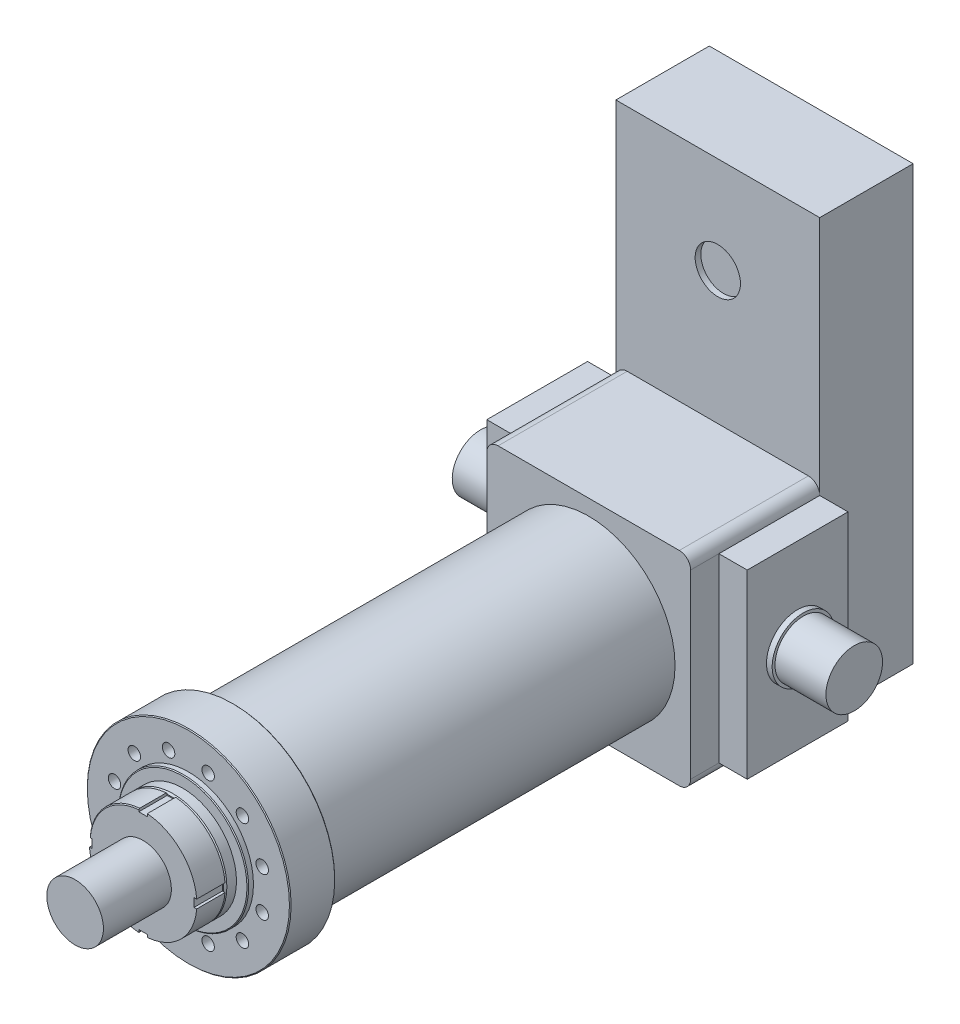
ISO-10303-21;
HEADER;
FILE_DESCRIPTION(('STEP AP214'),'2;1');
FILE_NAME('part.step','',(''),(''),'','','');
FILE_SCHEMA(('AUTOMOTIVE_DESIGN { 1 0 10303 214 1 1 1 1 }'));
ENDSEC;
DATA;
#1=APPLICATION_CONTEXT('core data for automotive mechanical design processes');
#2=APPLICATION_PROTOCOL_DEFINITION('international standard','automotive_design',2000,#1);
#3=PRODUCT_CONTEXT('',#1,'mechanical');
#4=PRODUCT('Part','Part','',(#3));
#5=PRODUCT_RELATED_PRODUCT_CATEGORY('part','',(#4));
#6=PRODUCT_DEFINITION_FORMATION('','',#4);
#7=PRODUCT_DEFINITION_CONTEXT('part definition',#1,'design');
#8=PRODUCT_DEFINITION('design','',#6,#7);
#9=PRODUCT_DEFINITION_SHAPE('','',#8);
#10=(LENGTH_UNIT() NAMED_UNIT(*) SI_UNIT(.MILLI.,.METRE.));
#11=(NAMED_UNIT(*) PLANE_ANGLE_UNIT() SI_UNIT($,.RADIAN.));
#12=(NAMED_UNIT(*) SI_UNIT($,.STERADIAN.) SOLID_ANGLE_UNIT());
#13=UNCERTAINTY_MEASURE_WITH_UNIT(LENGTH_MEASURE(1.E-05),#10,'distance_accuracy_value','');
#14=(GEOMETRIC_REPRESENTATION_CONTEXT(3) GLOBAL_UNCERTAINTY_ASSIGNED_CONTEXT((#13)) GLOBAL_UNIT_ASSIGNED_CONTEXT((#10,
#11,#12)) REPRESENTATION_CONTEXT('',''));
#15=CARTESIAN_POINT('',(0.,0.,0.));
#16=DIRECTION('',(0.,0.,1.));
#17=DIRECTION('',(1.,0.,0.));
#18=AXIS2_PLACEMENT_3D('',#15,#16,#17);
#19=CARTESIAN_POINT('',(-230.,0.,0.));
#20=DIRECTION('',(-1.,0.,0.));
#21=DIRECTION('',(0.,-1.,0.));
#22=AXIS2_PLACEMENT_3D('',#19,#20,#21);
#23=PLANE('',#22);
#24=DIRECTION('',(0.,-1.,0.));
#25=VECTOR('',#24,1.);
#26=CARTESIAN_POINT('',(-230.,160.,-228.));
#27=LINE('',#26,#25);
#28=CARTESIAN_POINT('',(-230.,160.,-228.));
#29=VERTEX_POINT('',#28);
#30=CARTESIAN_POINT('',(-230.,-160.,-228.));
#31=VERTEX_POINT('',#30);
#32=EDGE_CURVE('E353',#29,#31,#27,.T.);
#33=ORIENTED_EDGE('',*,*,#32,.T.);
#34=DIRECTION('',(0.,0.,1.));
#35=VECTOR('',#34,1.);
#36=CARTESIAN_POINT('',(-230.,-160.,-228.));
#37=LINE('',#36,#35);
#38=CARTESIAN_POINT('',(-230.,-160.,-50.));
#39=VERTEX_POINT('',#38);
#40=EDGE_CURVE('E357',#31,#39,#37,.T.);
#41=ORIENTED_EDGE('',*,*,#40,.T.);
#42=DIRECTION('',(0.,1.,0.));
#43=VECTOR('',#42,1.);
#44=CARTESIAN_POINT('',(-230.,160.,-50.));
#45=LINE('',#44,#43);
#46=CARTESIAN_POINT('',(-230.,160.,-50.));
#47=VERTEX_POINT('',#46);
#48=EDGE_CURVE('E361',#39,#47,#45,.T.);
#49=ORIENTED_EDGE('',*,*,#48,.T.);
#50=DIRECTION('',(0.,0.,-1.));
#51=VECTOR('',#50,1.);
#52=CARTESIAN_POINT('',(-230.,160.,-228.));
#53=LINE('',#52,#51);
#54=EDGE_CURVE('E364',#47,#29,#53,.T.);
#55=ORIENTED_EDGE('',*,*,#54,.T.);
#56=EDGE_LOOP('',(#33,#41,#49,#55));
#57=FACE_BOUND('',#56,.T.);
#58=CARTESIAN_POINT('',(-230.,1.23165366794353E-13,-139.));
#59=DIRECTION('',(-1.,0.,0.));
#60=DIRECTION('',(0.,-1.,0.));
#61=AXIS2_PLACEMENT_3D('',#58,#59,#60);
#62=CIRCLE('',#61,55.);
#63=CARTESIAN_POINT('',(-230.,-54.9999999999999,-139.));
#64=VERTEX_POINT('',#63);
#65=EDGE_CURVE('E2075',#64,#64,#62,.T.);
#66=ORIENTED_EDGE('',*,*,#65,.F.);
#67=EDGE_LOOP('',(#66));
#68=FACE_BOUND('',#67,.T.);
#69=ADVANCED_FACE('F39',(#57,#68),#23,.T.);
#70=CARTESIAN_POINT('',(180.,180.,-50.));
#71=DIRECTION('',(-1.,0.,0.));
#72=DIRECTION('',(0.,-1.,0.));
#73=AXIS2_PLACEMENT_3D('',#70,#71,#72);
#74=PLANE('',#73);
#75=DIRECTION('',(0.,-1.,0.));
#76=VECTOR('',#75,1.);
#77=CARTESIAN_POINT('',(180.,585.,-228.));
#78=LINE('',#77,#76);
#79=CARTESIAN_POINT('',(180.,585.,-228.));
#80=VERTEX_POINT('',#79);
#81=CARTESIAN_POINT('',(180.,160.,-228.));
#82=VERTEX_POINT('',#81);
#83=EDGE_CURVE('E405',#80,#82,#78,.T.);
#84=ORIENTED_EDGE('',*,*,#83,.T.);
#85=DIRECTION('',(0.,-1.,0.));
#86=VECTOR('',#85,1.);
#87=CARTESIAN_POINT('',(180.,160.,-228.));
#88=LINE('',#87,#86);
#89=CARTESIAN_POINT('',(180.,-160.,-228.));
#90=VERTEX_POINT('',#89);
#91=EDGE_CURVE('E339',#82,#90,#88,.T.);
#92=ORIENTED_EDGE('',*,*,#91,.T.);
#93=CARTESIAN_POINT('',(180.,-180.,-228.));
#94=VERTEX_POINT('',#93);
#95=EDGE_CURVE('E428',#90,#94,#78,.T.);
#96=ORIENTED_EDGE('',*,*,#95,.T.);
#97=DIRECTION('',(0.,0.,1.));
#98=VECTOR('',#97,1.);
#99=CARTESIAN_POINT('',(180.,-180.,-393.));
#100=LINE('',#99,#98);
#101=CARTESIAN_POINT('',(180.,-180.,-393.));
#102=VERTEX_POINT('',#101);
#103=EDGE_CURVE('E436',#102,#94,#100,.T.);
#104=ORIENTED_EDGE('',*,*,#103,.F.);
#105=DIRECTION('',(0.,-1.,0.));
#106=VECTOR('',#105,1.);
#107=CARTESIAN_POINT('',(180.,585.,-393.));
#108=LINE('',#107,#106);
#109=CARTESIAN_POINT('',(180.,585.,-393.));
#110=VERTEX_POINT('',#109);
#111=EDGE_CURVE('E412',#110,#102,#108,.T.);
#112=ORIENTED_EDGE('',*,*,#111,.F.);
#113=DIRECTION('',(0.,0.,1.));
#114=VECTOR('',#113,1.);
#115=CARTESIAN_POINT('',(180.,585.,-393.));
#116=LINE('',#115,#114);
#117=EDGE_CURVE('E432',#110,#80,#116,.T.);
#118=ORIENTED_EDGE('',*,*,#117,.T.);
#119=EDGE_LOOP('',(#84,#92,#96,#104,#112,#118));
#120=FACE_BOUND('',#119,.T.);
#121=ADVANCED_FACE('F961',(#120),#74,.F.);
#122=CARTESIAN_POINT('',(-180.,180.,-50.));
#123=DIRECTION('',(1.,0.,0.));
#124=DIRECTION('',(0.,1.,0.));
#125=AXIS2_PLACEMENT_3D('',#122,#123,#124);
#126=PLANE('',#125);
#127=DIRECTION('',(0.,-1.,0.));
#128=VECTOR('',#127,1.);
#129=CARTESIAN_POINT('',(-180.,160.,-228.));
#130=LINE('',#129,#128);
#131=CARTESIAN_POINT('',(-180.,160.,-228.));
#132=VERTEX_POINT('',#131);
#133=CARTESIAN_POINT('',(-180.,-160.,-228.));
#134=VERTEX_POINT('',#133);
#135=EDGE_CURVE('E346',#132,#134,#130,.T.);
#136=ORIENTED_EDGE('',*,*,#135,.F.);
#137=DIRECTION('',(0.,-1.,0.));
#138=VECTOR('',#137,1.);
#139=CARTESIAN_POINT('',(-180.,585.,-228.));
#140=LINE('',#139,#138);
#141=CARTESIAN_POINT('',(-180.,585.,-228.));
#142=VERTEX_POINT('',#141);
#143=EDGE_CURVE('E420',#142,#132,#140,.T.);
#144=ORIENTED_EDGE('',*,*,#143,.F.);
#145=DIRECTION('',(0.,0.,1.));
#146=VECTOR('',#145,1.);
#147=CARTESIAN_POINT('',(-180.,585.,-393.));
#148=LINE('',#147,#146);
#149=CARTESIAN_POINT('',(-180.,585.,-393.));
#150=VERTEX_POINT('',#149);
#151=EDGE_CURVE('E415',#150,#142,#148,.T.);
#152=ORIENTED_EDGE('',*,*,#151,.F.);
#153=DIRECTION('',(0.,-1.,0.));
#154=VECTOR('',#153,1.);
#155=CARTESIAN_POINT('',(-180.,585.,-393.));
#156=LINE('',#155,#154);
#157=CARTESIAN_POINT('',(-180.,-180.,-393.));
#158=VERTEX_POINT('',#157);
#159=EDGE_CURVE('E404',#150,#158,#156,.T.);
#160=ORIENTED_EDGE('',*,*,#159,.T.);
#161=DIRECTION('',(0.,0.,1.));
#162=VECTOR('',#161,1.);
#163=CARTESIAN_POINT('',(-180.,-180.,-393.));
#164=LINE('',#163,#162);
#165=CARTESIAN_POINT('',(-180.,-180.,-228.));
#166=VERTEX_POINT('',#165);
#167=EDGE_CURVE('E440',#158,#166,#164,.T.);
#168=ORIENTED_EDGE('',*,*,#167,.T.);
#169=EDGE_CURVE('E419',#134,#166,#140,.T.);
#170=ORIENTED_EDGE('',*,*,#169,.F.);
#171=EDGE_LOOP('',(#136,#144,#152,#160,#168,#170));
#172=FACE_BOUND('',#171,.T.);
#173=ADVANCED_FACE('F965',(#172),#126,.F.);
#174=DIRECTION('',(0.,1.,0.));
#175=VECTOR('',#174,1.);
#176=CARTESIAN_POINT('',(-180.,160.,-50.));
#177=LINE('',#176,#175);
#178=CARTESIAN_POINT('',(-180.,-160.,-50.));
#179=VERTEX_POINT('',#178);
#180=CARTESIAN_POINT('',(-180.,160.,-50.));
#181=VERTEX_POINT('',#180);
#182=EDGE_CURVE('E63',#179,#181,#177,.T.);
#183=ORIENTED_EDGE('',*,*,#182,.F.);
#184=DIRECTION('',(0.,0.,1.));
#185=VECTOR('',#184,1.);
#186=CARTESIAN_POINT('',(-180.,-160.,-50.));
#187=LINE('',#186,#185);
#188=CARTESIAN_POINT('',(-180.,-160.,0.));
#189=VERTEX_POINT('',#188);
#190=EDGE_CURVE('E1132',#179,#189,#187,.T.);
#191=ORIENTED_EDGE('',*,*,#190,.T.);
#192=DIRECTION('',(0.,1.,0.));
#193=VECTOR('',#192,1.);
#194=CARTESIAN_POINT('',(-180.,180.,0.));
#195=LINE('',#194,#193);
#196=CARTESIAN_POINT('',(-180.,160.,0.));
#197=VERTEX_POINT('',#196);
#198=EDGE_CURVE('E478',#189,#197,#195,.T.);
#199=ORIENTED_EDGE('',*,*,#198,.T.);
#200=DIRECTION('',(0.,0.,1.));
#201=VECTOR('',#200,1.);
#202=CARTESIAN_POINT('',(-180.,160.,-50.));
#203=LINE('',#202,#201);
#204=EDGE_CURVE('E1129',#197,#181,#203,.F.);
#205=ORIENTED_EDGE('',*,*,#204,.T.);
#206=EDGE_LOOP('',(#183,#191,#199,#205));
#207=FACE_BOUND('',#206,.T.);
#208=ADVANCED_FACE('F911',(#207),#126,.F.);
#209=CARTESIAN_POINT('',(0.,0.,627.));
#210=DIRECTION('',(0.,0.,-1.));
#211=DIRECTION('',(-1.,0.,0.));
#212=AXIS2_PLACEMENT_3D('',#209,#210,#211);
#213=CYLINDRICAL_SURFACE('',#212,152.5);
#214=CARTESIAN_POINT('',(0.,0.,627.));
#215=DIRECTION('',(0.,0.,1.));
#216=DIRECTION('',(1.,0.,0.));
#217=AXIS2_PLACEMENT_3D('',#214,#215,#216);
#218=CIRCLE('',#217,152.5);
#219=CARTESIAN_POINT('',(152.5,0.,627.));
#220=VERTEX_POINT('',#219);
#221=EDGE_CURVE('E683',#220,#220,#218,.T.);
#222=ORIENTED_EDGE('',*,*,#221,.F.);
#223=EDGE_LOOP('',(#222));
#224=FACE_BOUND('',#223,.T.);
#225=CARTESIAN_POINT('',(0.,0.,0.));
#226=DIRECTION('',(0.,0.,1.));
#227=DIRECTION('',(1.,0.,0.));
#228=AXIS2_PLACEMENT_3D('',#225,#226,#227);
#229=CIRCLE('',#228,152.5);
#230=CARTESIAN_POINT('',(152.5,0.,0.));
#231=VERTEX_POINT('',#230);
#232=EDGE_CURVE('E497',#231,#231,#229,.T.);
#233=ORIENTED_EDGE('',*,*,#232,.T.);
#234=EDGE_LOOP('',(#233));
#235=FACE_BOUND('',#234,.T.);
#236=CARTESIAN_POINT('',(-152.5,0.,567.5));
#237=CARTESIAN_POINT('',(-152.500001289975,0.448200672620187,567.500004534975));
#238=CARTESIAN_POINT('',(-152.49802011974,0.896332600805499,567.481160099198));
#239=CARTESIAN_POINT('',(-152.49015354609,1.7895422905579,567.405923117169));
#240=CARTESIAN_POINT('',(-152.48426721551,2.23461930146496,567.349521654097));
#241=CARTESIAN_POINT('',(-152.46874661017,3.11882436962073,567.19949799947));
#242=CARTESIAN_POINT('',(-152.459108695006,3.55794621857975,567.105839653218));
#243=CARTESIAN_POINT('',(-152.436358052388,4.42668632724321,566.881990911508));
#244=CARTESIAN_POINT('',(-152.423245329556,4.8563045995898,566.75180056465));
#245=CARTESIAN_POINT('',(-152.393924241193,5.70272636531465,566.455928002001));
#246=CARTESIAN_POINT('',(-152.377717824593,6.11953773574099,566.290268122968));
#247=CARTESIAN_POINT('',(-152.342659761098,6.93770102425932,565.924599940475));
#248=CARTESIAN_POINT('',(-152.323808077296,7.33905272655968,565.724591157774));
#249=CARTESIAN_POINT('',(-152.283993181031,8.12339897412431,565.291700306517));
#250=CARTESIAN_POINT('',(-152.263030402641,8.50639726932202,565.058824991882));
#251=CARTESIAN_POINT('',(-152.219577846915,9.25145377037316,564.561819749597));
#252=CARTESIAN_POINT('',(-152.197088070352,9.61351198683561,564.297689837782));
#253=CARTESIAN_POINT('',(-152.151130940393,10.3154013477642,563.739051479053));
#254=CARTESIAN_POINT('',(-152.127660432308,10.6551500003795,563.444439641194));
#255=CARTESIAN_POINT('',(-152.080478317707,11.3086456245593,562.82768277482));
#256=CARTESIAN_POINT('',(-152.056766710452,11.6223925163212,562.505537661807));
#257=CARTESIAN_POINT('',(-152.009771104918,12.2216965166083,561.835957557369));
#258=CARTESIAN_POINT('',(-151.986487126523,12.5072523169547,561.488521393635));
#259=CARTESIAN_POINT('',(-151.941006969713,13.0481450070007,560.770805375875));
#260=CARTESIAN_POINT('',(-151.918810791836,13.3034818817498,560.400525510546));
#261=CARTESIAN_POINT('',(-151.87608610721,13.7826883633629,559.638822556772));
#262=CARTESIAN_POINT('',(-151.855561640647,14.0064826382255,559.247351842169));
#263=CARTESIAN_POINT('',(-151.816825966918,14.420283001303,558.446830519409));
#264=CARTESIAN_POINT('',(-151.798614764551,14.6102890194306,558.037779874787));
#265=CARTESIAN_POINT('',(-151.765029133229,14.9551317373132,557.205009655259));
#266=CARTESIAN_POINT('',(-151.74965464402,15.1099691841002,556.781290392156));
#267=CARTESIAN_POINT('',(-151.722185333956,15.3833471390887,555.922196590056));
#268=CARTESIAN_POINT('',(-151.710090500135,15.5018877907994,555.486822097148));
#269=CARTESIAN_POINT('',(-151.689568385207,15.7014291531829,554.609163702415));
#270=CARTESIAN_POINT('',(-151.681127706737,15.7825670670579,554.166911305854));
#271=CARTESIAN_POINT('',(-151.668092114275,15.9073498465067,553.277092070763));
#272=CARTESIAN_POINT('',(-151.663497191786,15.9509947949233,552.829525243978));
#273=CARTESIAN_POINT('',(-151.658285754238,16.0004682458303,551.932294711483));
#274=CARTESIAN_POINT('',(-151.657669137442,16.0062977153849,551.482631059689));
#275=CARTESIAN_POINT('',(-151.660431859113,15.9800995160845,550.584420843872));
#276=CARTESIAN_POINT('',(-151.663811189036,15.9480719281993,550.135874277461));
#277=CARTESIAN_POINT('',(-151.674446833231,15.8466008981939,549.244901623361));
#278=CARTESIAN_POINT('',(-151.681687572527,15.7773077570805,548.802458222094));
#279=CARTESIAN_POINT('',(-151.699829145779,15.6019101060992,547.9250074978));
#280=CARTESIAN_POINT('',(-151.710729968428,15.4958057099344,547.490000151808));
#281=CARTESIAN_POINT('',(-151.735880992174,15.2475561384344,546.630489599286));
#282=CARTESIAN_POINT('',(-151.750131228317,15.1054105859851,546.205986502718));
#283=CARTESIAN_POINT('',(-151.781575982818,14.7861052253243,545.370472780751));
#284=CARTESIAN_POINT('',(-151.798770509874,14.6089453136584,544.959462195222));
#285=CARTESIAN_POINT('',(-151.83565305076,14.2204984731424,544.15301924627));
#286=CARTESIAN_POINT('',(-151.855345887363,14.0091453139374,543.7576190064));
#287=CARTESIAN_POINT('',(-151.896640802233,13.5540653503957,542.986015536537));
#288=CARTESIAN_POINT('',(-151.918242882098,13.3103385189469,542.609812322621));
#289=CARTESIAN_POINT('',(-151.962747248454,12.7922253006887,541.879213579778));
#290=CARTESIAN_POINT('',(-151.985649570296,12.5178380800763,541.52481864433));
#291=CARTESIAN_POINT('',(-152.032109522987,11.9403334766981,540.840311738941));
#292=CARTESIAN_POINT('',(-152.055667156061,11.6372159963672,540.510199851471));
#293=CARTESIAN_POINT('',(-152.102890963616,11.0028265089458,539.875015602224));
#294=CARTESIAN_POINT('',(-152.126557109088,10.6714248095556,539.570072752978));
#295=CARTESIAN_POINT('',(-152.173213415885,9.98407466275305,538.989175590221));
#296=CARTESIAN_POINT('',(-152.196203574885,9.62812613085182,538.713221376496));
#297=CARTESIAN_POINT('',(-152.240857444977,8.89418144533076,538.19225578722));
#298=CARTESIAN_POINT('',(-152.262521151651,8.516185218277,537.94724451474));
#299=CARTESIAN_POINT('',(-152.303908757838,7.74080626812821,537.489914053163));
#300=CARTESIAN_POINT('',(-152.323632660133,7.34342357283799,537.27759481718));
#301=CARTESIAN_POINT('',(-152.360585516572,6.53199332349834,536.887135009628));
#302=CARTESIAN_POINT('',(-152.377813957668,6.11794236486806,536.709001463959));
#303=CARTESIAN_POINT('',(-152.409281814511,5.27618993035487,536.38826037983));
#304=CARTESIAN_POINT('',(-152.423521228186,4.84848844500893,536.245652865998));
#305=CARTESIAN_POINT('',(-152.448605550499,3.98249754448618,535.997011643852));
#306=CARTESIAN_POINT('',(-152.459450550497,3.54420841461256,535.89097695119));
#307=CARTESIAN_POINT('',(-152.477437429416,2.66017303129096,535.716258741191));
#308=CARTESIAN_POINT('',(-152.484579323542,2.21442680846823,535.647575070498));
#309=CARTESIAN_POINT('',(-152.494931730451,1.32080186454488,535.548303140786));
#310=CARTESIAN_POINT('',(-152.498160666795,0.872943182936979,535.517536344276));
#311=CARTESIAN_POINT('',(-152.500657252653,-0.0237861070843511,535.493732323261));
#312=CARTESIAN_POINT('',(-152.499924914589,-0.472656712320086,535.50069498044));
#313=CARTESIAN_POINT('',(-152.494519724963,-1.36819608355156,535.552297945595));
#314=CARTESIAN_POINT('',(-152.489846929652,-1.8148648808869,535.596937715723));
#315=CARTESIAN_POINT('',(-152.476693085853,-2.70281936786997,535.723565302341));
#316=CARTESIAN_POINT('',(-152.468212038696,-3.14410505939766,535.805553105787));
#317=CARTESIAN_POINT('',(-152.447704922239,-4.01715075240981,536.006044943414));
#318=CARTESIAN_POINT('',(-152.435687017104,-4.44893025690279,536.124464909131));
#319=CARTESIAN_POINT('',(-152.408436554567,-5.30095814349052,536.397023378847));
#320=CARTESIAN_POINT('',(-152.393204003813,-5.72120654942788,536.551161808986));
#321=CARTESIAN_POINT('',(-152.359950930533,-6.54723091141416,536.894051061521));
#322=CARTESIAN_POINT('',(-152.34193035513,-6.95300659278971,537.082802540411));
#323=CARTESIAN_POINT('',(-152.303605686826,-7.74724407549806,537.493569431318));
#324=CARTESIAN_POINT('',(-152.28330158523,-8.13570581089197,537.715584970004));
#325=CARTESIAN_POINT('',(-152.240899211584,-8.89400737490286,538.192186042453));
#326=CARTESIAN_POINT('',(-152.218794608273,-9.26377336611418,538.446888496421));
#327=CARTESIAN_POINT('',(-152.173478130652,-9.98055818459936,538.986420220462));
#328=CARTESIAN_POINT('',(-152.150266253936,-10.3275769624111,539.27124955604));
#329=CARTESIAN_POINT('',(-152.103387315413,-10.9964538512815,539.869041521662));
#330=CARTESIAN_POINT('',(-152.079720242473,-11.3183113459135,540.182004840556));
#331=CARTESIAN_POINT('',(-152.032597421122,-11.9346077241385,540.8338700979));
#332=CARTESIAN_POINT('',(-152.009141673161,-12.2290465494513,541.172772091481));
#333=CARTESIAN_POINT('',(-151.963011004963,-12.7895544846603,541.875546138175));
#334=CARTESIAN_POINT('',(-151.940339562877,-13.0555060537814,542.239512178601));
#335=CARTESIAN_POINT('',(-151.896521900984,-13.5558001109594,542.988645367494));
#336=CARTESIAN_POINT('',(-151.875375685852,-13.7901425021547,543.373812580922));
#337=CARTESIAN_POINT('',(-151.835213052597,-14.2255368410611,544.162626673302));
#338=CARTESIAN_POINT('',(-151.816196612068,-14.426589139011,544.566273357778));
#339=CARTESIAN_POINT('',(-151.780838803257,-14.7939530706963,545.389190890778));
#340=CARTESIAN_POINT('',(-151.764497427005,-14.9602648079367,545.808461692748));
#341=CARTESIAN_POINT('',(-151.734988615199,-15.256650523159,546.658825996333));
#342=CARTESIAN_POINT('',(-151.721815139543,-15.3867935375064,547.089895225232));
#343=CARTESIAN_POINT('',(-151.698980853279,-15.6103121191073,547.961555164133));
#344=CARTESIAN_POINT('',(-151.689320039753,-15.7036877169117,548.402145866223));
#345=CARTESIAN_POINT('',(-151.673790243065,-15.8529806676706,549.289683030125));
#346=CARTESIAN_POINT('',(-151.667921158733,-15.908899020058,549.736629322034));
#347=CARTESIAN_POINT('',(-151.660144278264,-15.9828666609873,550.633678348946));
#348=CARTESIAN_POINT('',(-151.658236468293,-16.0009160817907,551.08378107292));
#349=CARTESIAN_POINT('',(-151.658436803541,-15.9990169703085,551.981712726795));
#350=CARTESIAN_POINT('',(-151.660525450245,-15.979252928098,552.429542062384));
#351=CARTESIAN_POINT('',(-151.668620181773,-15.9022371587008,553.321928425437));
#352=CARTESIAN_POINT('',(-151.674626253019,-15.8449855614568,553.766485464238));
#353=CARTESIAN_POINT('',(-151.69038372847,-15.6934151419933,554.649166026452));
#354=CARTESIAN_POINT('',(-151.700135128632,-15.5990963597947,555.087289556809));
#355=CARTESIAN_POINT('',(-151.723104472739,-15.3740802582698,555.953999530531));
#356=CARTESIAN_POINT('',(-151.736322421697,-15.2433828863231,556.382585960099));
#357=CARTESIAN_POINT('',(-151.76584549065,-14.9465835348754,557.227123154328));
#358=CARTESIAN_POINT('',(-151.782150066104,-14.7804877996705,557.643076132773));
#359=CARTESIAN_POINT('',(-151.817384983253,-14.4140719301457,558.459506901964));
#360=CARTESIAN_POINT('',(-151.836315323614,-14.2137518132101,558.859984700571));
#361=CARTESIAN_POINT('',(-151.876266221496,-13.7803156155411,559.642666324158));
#362=CARTESIAN_POINT('',(-151.897286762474,-13.5471997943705,560.024870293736));
#363=CARTESIAN_POINT('',(-151.940825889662,-13.0498169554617,560.768350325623));
#364=CARTESIAN_POINT('',(-151.963344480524,-12.7855498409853,561.129626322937));
#365=CARTESIAN_POINT('',(-152.009354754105,-12.226409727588,561.830380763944));
#366=CARTESIAN_POINT('',(-152.032850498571,-11.9313992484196,562.169749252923));
#367=CARTESIAN_POINT('',(-152.080051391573,-11.3138777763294,562.822456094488));
#368=CARTESIAN_POINT('',(-152.103756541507,-10.9913665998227,563.135794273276));
#369=CARTESIAN_POINT('',(-152.150712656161,-10.3210235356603,563.734313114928));
#370=CARTESIAN_POINT('',(-152.173963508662,-9.97318548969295,564.019486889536));
#371=CARTESIAN_POINT('',(-152.21934851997,-9.25470030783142,564.559575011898));
#372=CARTESIAN_POINT('',(-152.241482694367,-8.88405349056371,564.814489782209));
#373=CARTESIAN_POINT('',(-152.284068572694,-8.12149344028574,565.292914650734));
#374=CARTESIAN_POINT('',(-152.304515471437,-7.72952441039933,565.516336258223));
#375=CARTESIAN_POINT('',(-152.343077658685,-6.92803336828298,565.929331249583));
#376=CARTESIAN_POINT('',(-152.36119294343,-6.51851132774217,566.118904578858));
#377=CARTESIAN_POINT('',(-152.394559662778,-5.68522805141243,566.462656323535));
#378=CARTESIAN_POINT('',(-152.409813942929,-5.26148146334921,566.616869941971));
#379=CARTESIAN_POINT('',(-152.437044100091,-4.4025312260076,566.888979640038));
#380=CARTESIAN_POINT('',(-152.449020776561,-3.96733039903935,567.006884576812));
#381=CARTESIAN_POINT('',(-152.472564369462,-2.94974180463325,567.23690209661));
#382=CARTESIAN_POINT('',(-152.482811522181,-2.36420974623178,567.335467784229));
#383=CARTESIAN_POINT('',(-152.496528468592,-1.1857450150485,567.467013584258));
#384=CARTESIAN_POINT('',(-152.499998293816,-0.592812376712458,567.499994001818));
#385=CARTESIAN_POINT('',(-152.5,0.,567.5));
#386=B_SPLINE_CURVE_WITH_KNOTS('',3,(#236,#237,#238,#239,#240,#241,#242,#243,#244,#245,#246,
#247,#248,#249,#250,#251,#252,#253,#254,#255,#256,#257,#258,#259,#260,#261,#262,#263,#264,#265,
#266,#267,#268,#269,#270,#271,#272,#273,#274,#275,#276,#277,#278,#279,#280,#281,#282,#283,#284,
#285,#286,#287,#288,#289,#290,#291,#292,#293,#294,#295,#296,#297,#298,#299,#300,#301,#302,#303,
#304,#305,#306,#307,#308,#309,#310,#311,#312,#313,#314,#315,#316,#317,#318,#319,#320,#321,#322,
#323,#324,#325,#326,#327,#328,#329,#330,#331,#332,#333,#334,#335,#336,#337,#338,#339,#340,#341,
#342,#343,#344,#345,#346,#347,#348,#349,#350,#351,#352,#353,#354,#355,#356,#357,#358,#359,#360,
#361,#362,#363,#364,#365,#366,#367,#368,#369,#370,#371,#372,#373,#374,#375,#376,#377,#378,#379,
#380,#381,#382,#383,#384,#385),.UNSPECIFIED.,.T.,.F.,(4,2,2,2,2,2,2,2,2,2,2,2,2,2,2,2,2,2,2,2,2,
2,2,2,2,2,2,2,2,2,2,2,2,2,2,2,2,2,2,2,2,2,2,2,2,2,2,2,2,2,2,2,2,2,2,2,2,2,2,2,2,2,2,2,2,2,2,2,2,
2,2,2,2,2,4),(0.,1.34408353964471,2.68848630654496,4.03419689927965,5.37990570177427,
6.72476953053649,8.06965212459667,9.41425875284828,10.7588646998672,12.1081909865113,
13.4575214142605,14.8069144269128,16.1563081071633,17.5088717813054,18.861438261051,
20.2139760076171,21.5665084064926,22.9140390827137,24.2615667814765,25.6090600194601,
26.9565503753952,28.2986462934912,29.6407380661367,30.9828438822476,32.3249536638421,
33.6696948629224,35.0144371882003,36.359216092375,37.7039995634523,39.0553197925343,
40.4066446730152,41.7579740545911,43.1093014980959,44.4609063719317,45.8125121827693,
47.1640816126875,48.5156454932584,49.8608207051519,51.205991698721,52.551143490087,
53.8962948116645,55.2383651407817,56.5804326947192,57.9225257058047,59.264623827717,
60.6116638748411,61.9587068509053,63.3057828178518,64.652861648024,66.0053003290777,
67.3577431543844,68.7101717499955,70.0625963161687,71.412421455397,72.7622454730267,
74.1120334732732,75.4618167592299,76.8050313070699,78.1482411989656,79.4914496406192,
80.8346600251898,82.1776336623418,83.5206066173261,84.863568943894,86.2065354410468,
87.5557885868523,88.9050507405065,90.2546420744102,91.6042145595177,92.9575065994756,
94.3108008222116,95.6627418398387,97.0143528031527,98.7921124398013,100.569863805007),.UNSPECIFIED.);
#387=CARTESIAN_POINT('',(-152.5,0.,567.5));
#388=VERTEX_POINT('',#387);
#389=EDGE_CURVE('E916',#388,#388,#386,.T.);
#390=ORIENTED_EDGE('',*,*,#389,.F.);
#391=EDGE_LOOP('',(#390));
#392=FACE_BOUND('',#391,.T.);
#393=CARTESIAN_POINT('',(-152.5,0.,43.));
#394=CARTESIAN_POINT('',(-152.500001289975,0.448200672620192,43.0000045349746));
#395=CARTESIAN_POINT('',(-152.49802011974,0.896332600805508,42.9811600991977));
#396=CARTESIAN_POINT('',(-152.49015354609,1.78954229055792,42.905923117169));
#397=CARTESIAN_POINT('',(-152.48426721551,2.23461930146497,42.8495216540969));
#398=CARTESIAN_POINT('',(-152.46874661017,3.11882436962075,42.6994979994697));
#399=CARTESIAN_POINT('',(-152.459108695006,3.55794621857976,42.6058396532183));
#400=CARTESIAN_POINT('',(-152.436358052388,4.42668632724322,42.3819909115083));
#401=CARTESIAN_POINT('',(-152.423245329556,4.85630459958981,42.2518005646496));
#402=CARTESIAN_POINT('',(-152.393924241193,5.70272636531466,41.9559280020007));
#403=CARTESIAN_POINT('',(-152.377717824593,6.11953773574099,41.7902681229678));
#404=CARTESIAN_POINT('',(-152.342659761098,6.93770102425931,41.4245999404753));
#405=CARTESIAN_POINT('',(-152.323808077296,7.33905272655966,41.2245911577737));
#406=CARTESIAN_POINT('',(-152.283993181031,8.1233989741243,40.7917003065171));
#407=CARTESIAN_POINT('',(-152.263030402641,8.50639726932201,40.5588249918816));
#408=CARTESIAN_POINT('',(-152.219577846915,9.25145377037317,40.0618197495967));
#409=CARTESIAN_POINT('',(-152.197088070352,9.61351198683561,39.7976898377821));
#410=CARTESIAN_POINT('',(-152.151130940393,10.3154013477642,39.239051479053));
#411=CARTESIAN_POINT('',(-152.127660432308,10.6551500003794,38.944439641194));
#412=CARTESIAN_POINT('',(-152.080478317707,11.3086456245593,38.3276827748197));
#413=CARTESIAN_POINT('',(-152.056766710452,11.6223925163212,38.0055376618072));
#414=CARTESIAN_POINT('',(-152.009771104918,12.2216965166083,37.3359575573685));
#415=CARTESIAN_POINT('',(-151.986487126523,12.5072523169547,36.9885213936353));
#416=CARTESIAN_POINT('',(-151.941006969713,13.0481450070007,36.270805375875));
#417=CARTESIAN_POINT('',(-151.918810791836,13.3034818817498,35.9005255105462));
#418=CARTESIAN_POINT('',(-151.87608610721,13.7826883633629,35.1388225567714));
#419=CARTESIAN_POINT('',(-151.855561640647,14.0064826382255,34.7473518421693));
#420=CARTESIAN_POINT('',(-151.816825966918,14.420283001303,33.9468305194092));
#421=CARTESIAN_POINT('',(-151.798614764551,14.6102890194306,33.5377798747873));
#422=CARTESIAN_POINT('',(-151.765029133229,14.9551317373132,32.7050096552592));
#423=CARTESIAN_POINT('',(-151.74965464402,15.1099691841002,32.2812903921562));
#424=CARTESIAN_POINT('',(-151.722185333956,15.3833471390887,31.4221965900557));
#425=CARTESIAN_POINT('',(-151.710090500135,15.5018877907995,30.9868220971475));
#426=CARTESIAN_POINT('',(-151.689568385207,15.7014291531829,30.1091637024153));
#427=CARTESIAN_POINT('',(-151.681127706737,15.782567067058,29.6669113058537));
#428=CARTESIAN_POINT('',(-151.668092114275,15.9073498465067,28.7770920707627));
#429=CARTESIAN_POINT('',(-151.663497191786,15.9509947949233,28.3295252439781));
#430=CARTESIAN_POINT('',(-151.658285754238,16.0004682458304,27.4322947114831));
#431=CARTESIAN_POINT('',(-151.657669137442,16.0062977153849,26.9826310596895));
#432=CARTESIAN_POINT('',(-151.660431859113,15.9800995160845,26.0844208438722));
#433=CARTESIAN_POINT('',(-151.663811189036,15.9480719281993,25.6358742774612));
#434=CARTESIAN_POINT('',(-151.674446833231,15.8466008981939,24.7449016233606));
#435=CARTESIAN_POINT('',(-151.681687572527,15.7773077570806,24.3024582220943));
#436=CARTESIAN_POINT('',(-151.699829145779,15.6019101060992,23.4250074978));
#437=CARTESIAN_POINT('',(-151.710729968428,15.4958057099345,22.9900001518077));
#438=CARTESIAN_POINT('',(-151.735880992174,15.2475561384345,22.1304895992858));
#439=CARTESIAN_POINT('',(-151.750131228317,15.1054105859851,21.7059865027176));
#440=CARTESIAN_POINT('',(-151.781575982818,14.7861052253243,20.8704727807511));
#441=CARTESIAN_POINT('',(-151.798770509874,14.6089453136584,20.4594621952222));
#442=CARTESIAN_POINT('',(-151.83565305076,14.2204984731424,19.6530192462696));
#443=CARTESIAN_POINT('',(-151.855345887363,14.0091453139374,19.2576190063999));
#444=CARTESIAN_POINT('',(-151.896640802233,13.5540653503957,18.4860155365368));
#445=CARTESIAN_POINT('',(-151.918242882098,13.3103385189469,18.1098123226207));
#446=CARTESIAN_POINT('',(-151.962747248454,12.7922253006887,17.3792135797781));
#447=CARTESIAN_POINT('',(-151.985649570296,12.5178380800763,17.0248186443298));
#448=CARTESIAN_POINT('',(-152.032109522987,11.9403334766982,16.3403117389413));
#449=CARTESIAN_POINT('',(-152.055667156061,11.6372159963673,16.0101998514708));
#450=CARTESIAN_POINT('',(-152.102890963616,11.0028265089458,15.3750156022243));
#451=CARTESIAN_POINT('',(-152.126557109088,10.6714248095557,15.0700727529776));
#452=CARTESIAN_POINT('',(-152.173213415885,9.98407466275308,14.4891755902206));
#453=CARTESIAN_POINT('',(-152.196203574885,9.62812613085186,14.2132213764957));
#454=CARTESIAN_POINT('',(-152.240857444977,8.89418144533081,13.6922557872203));
#455=CARTESIAN_POINT('',(-152.262521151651,8.51618521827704,13.4472445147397));
#456=CARTESIAN_POINT('',(-152.303908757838,7.74080626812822,12.9899140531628));
#457=CARTESIAN_POINT('',(-152.323632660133,7.34342357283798,12.7775948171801));
#458=CARTESIAN_POINT('',(-152.360585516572,6.53199332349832,12.3871350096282));
#459=CARTESIAN_POINT('',(-152.377813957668,6.11794236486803,12.2090014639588));
#460=CARTESIAN_POINT('',(-152.409281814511,5.27618993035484,11.8882603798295));
#461=CARTESIAN_POINT('',(-152.423521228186,4.8484884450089,11.7456528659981));
#462=CARTESIAN_POINT('',(-152.448605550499,3.98249754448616,11.4970116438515));
#463=CARTESIAN_POINT('',(-152.459450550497,3.54420841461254,11.3909769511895));
#464=CARTESIAN_POINT('',(-152.477437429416,2.66017303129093,11.216258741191));
#465=CARTESIAN_POINT('',(-152.484579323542,2.2144268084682,11.1475750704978));
#466=CARTESIAN_POINT('',(-152.494931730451,1.32080186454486,11.048303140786));
#467=CARTESIAN_POINT('',(-152.498160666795,0.872943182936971,11.0175363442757));
#468=CARTESIAN_POINT('',(-152.500657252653,-0.0237861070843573,10.9937323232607));
#469=CARTESIAN_POINT('',(-152.499924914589,-0.472656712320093,11.0006949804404));
#470=CARTESIAN_POINT('',(-152.494519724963,-1.36819608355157,11.0522979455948));
#471=CARTESIAN_POINT('',(-152.489846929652,-1.81486488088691,11.0969377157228));
#472=CARTESIAN_POINT('',(-152.476693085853,-2.70281936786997,11.2235653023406));
#473=CARTESIAN_POINT('',(-152.468212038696,-3.14410505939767,11.3055531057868));
#474=CARTESIAN_POINT('',(-152.447704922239,-4.0171507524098,11.5060449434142));
#475=CARTESIAN_POINT('',(-152.435687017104,-4.44893025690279,11.6244649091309));
#476=CARTESIAN_POINT('',(-152.408436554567,-5.30095814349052,11.8970233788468));
#477=CARTESIAN_POINT('',(-152.393204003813,-5.72120654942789,12.0511618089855));
#478=CARTESIAN_POINT('',(-152.359950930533,-6.54723091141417,12.394051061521));
#479=CARTESIAN_POINT('',(-152.34193035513,-6.9530065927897,12.5828025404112));
#480=CARTESIAN_POINT('',(-152.303605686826,-7.74724407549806,12.9935694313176));
#481=CARTESIAN_POINT('',(-152.28330158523,-8.13570581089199,13.2155849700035));
#482=CARTESIAN_POINT('',(-152.240899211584,-8.89400737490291,13.6921860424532));
#483=CARTESIAN_POINT('',(-152.218794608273,-9.26377336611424,13.946888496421));
#484=CARTESIAN_POINT('',(-152.173478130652,-9.98055818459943,14.4864202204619));
#485=CARTESIAN_POINT('',(-152.150266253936,-10.3275769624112,14.7712495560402));
#486=CARTESIAN_POINT('',(-152.103387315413,-10.9964538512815,15.3690415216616));
#487=CARTESIAN_POINT('',(-152.079720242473,-11.3183113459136,15.6820048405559));
#488=CARTESIAN_POINT('',(-152.032597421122,-11.9346077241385,16.3338700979));
#489=CARTESIAN_POINT('',(-152.009141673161,-12.2290465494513,16.6727720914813));
#490=CARTESIAN_POINT('',(-151.963011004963,-12.7895544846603,17.3755461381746));
#491=CARTESIAN_POINT('',(-151.940339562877,-13.0555060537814,17.7395121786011));
#492=CARTESIAN_POINT('',(-151.896521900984,-13.5558001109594,18.4886453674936));
#493=CARTESIAN_POINT('',(-151.875375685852,-13.7901425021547,18.8738125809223));
#494=CARTESIAN_POINT('',(-151.835213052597,-14.2255368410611,19.6626266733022));
#495=CARTESIAN_POINT('',(-151.816196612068,-14.426589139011,20.0662733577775));
#496=CARTESIAN_POINT('',(-151.780838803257,-14.7939530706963,20.8891908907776));
#497=CARTESIAN_POINT('',(-151.764497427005,-14.9602648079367,21.3084616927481));
#498=CARTESIAN_POINT('',(-151.734988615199,-15.2566505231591,22.158825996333));
#499=CARTESIAN_POINT('',(-151.721815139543,-15.3867935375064,22.5898952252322));
#500=CARTESIAN_POINT('',(-151.698980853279,-15.6103121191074,23.4615551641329));
#501=CARTESIAN_POINT('',(-151.689320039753,-15.7036877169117,23.9021458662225));
#502=CARTESIAN_POINT('',(-151.673790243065,-15.8529806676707,24.7896830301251));
#503=CARTESIAN_POINT('',(-151.667921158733,-15.908899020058,25.2366293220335));
#504=CARTESIAN_POINT('',(-151.660144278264,-15.9828666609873,26.1336783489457));
#505=CARTESIAN_POINT('',(-151.658236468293,-16.0009160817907,26.5837810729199));
#506=CARTESIAN_POINT('',(-151.658436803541,-15.9990169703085,27.481712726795));
#507=CARTESIAN_POINT('',(-151.660525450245,-15.979252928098,27.9295420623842));
#508=CARTESIAN_POINT('',(-151.668620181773,-15.9022371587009,28.8219284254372));
#509=CARTESIAN_POINT('',(-151.674626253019,-15.8449855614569,29.2664854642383));
#510=CARTESIAN_POINT('',(-151.69038372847,-15.6934151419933,30.1491660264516));
#511=CARTESIAN_POINT('',(-151.700135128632,-15.5990963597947,30.5872895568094));
#512=CARTESIAN_POINT('',(-151.723104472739,-15.3740802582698,31.4539995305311));
#513=CARTESIAN_POINT('',(-151.736322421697,-15.2433828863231,31.8825859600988));
#514=CARTESIAN_POINT('',(-151.76584549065,-14.9465835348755,32.7271231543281));
#515=CARTESIAN_POINT('',(-151.782150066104,-14.7804877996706,33.1430761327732));
#516=CARTESIAN_POINT('',(-151.817384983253,-14.4140719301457,33.9595069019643));
#517=CARTESIAN_POINT('',(-151.836315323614,-14.2137518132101,34.3599847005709));
#518=CARTESIAN_POINT('',(-151.876266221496,-13.7803156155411,35.1426663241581));
#519=CARTESIAN_POINT('',(-151.897286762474,-13.5471997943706,35.5248702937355));
#520=CARTESIAN_POINT('',(-151.940825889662,-13.0498169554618,36.2683503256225));
#521=CARTESIAN_POINT('',(-151.963344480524,-12.7855498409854,36.6296263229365));
#522=CARTESIAN_POINT('',(-152.009354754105,-12.2264097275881,37.3303807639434));
#523=CARTESIAN_POINT('',(-152.032850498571,-11.9313992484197,37.6697492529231));
#524=CARTESIAN_POINT('',(-152.080051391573,-11.3138777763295,38.3224560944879));
#525=CARTESIAN_POINT('',(-152.103756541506,-10.9913665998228,38.6357942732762));
#526=CARTESIAN_POINT('',(-152.150712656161,-10.3210235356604,39.2343131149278));
#527=CARTESIAN_POINT('',(-152.173963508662,-9.97318548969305,39.5194868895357));
#528=CARTESIAN_POINT('',(-152.21934851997,-9.2547003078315,40.0595750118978));
#529=CARTESIAN_POINT('',(-152.241482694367,-8.88405349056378,40.3144897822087));
#530=CARTESIAN_POINT('',(-152.284068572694,-8.12149344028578,40.7929146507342));
#531=CARTESIAN_POINT('',(-152.304515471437,-7.72952441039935,41.0163362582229));
#532=CARTESIAN_POINT('',(-152.343077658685,-6.92803336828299,41.4293312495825));
#533=CARTESIAN_POINT('',(-152.36119294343,-6.51851132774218,41.6189045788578));
#534=CARTESIAN_POINT('',(-152.394559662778,-5.68522805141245,41.9626563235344));
#535=CARTESIAN_POINT('',(-152.409813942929,-5.26148146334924,42.1168699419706));
#536=CARTESIAN_POINT('',(-152.437044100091,-4.40253122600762,42.3889796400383));
#537=CARTESIAN_POINT('',(-152.449020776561,-3.96733039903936,42.5068845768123));
#538=CARTESIAN_POINT('',(-152.472564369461,-2.94974180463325,42.7369020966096));
#539=CARTESIAN_POINT('',(-152.482811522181,-2.36420974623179,42.8354677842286));
#540=CARTESIAN_POINT('',(-152.496528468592,-1.18574501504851,42.9670135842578));
#541=CARTESIAN_POINT('',(-152.499998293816,-0.592812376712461,42.9999940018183));
#542=CARTESIAN_POINT('',(-152.5,0.,43.));
#543=B_SPLINE_CURVE_WITH_KNOTS('',3,(#393,#394,#395,#396,#397,#398,#399,#400,#401,#402,#403,
#404,#405,#406,#407,#408,#409,#410,#411,#412,#413,#414,#415,#416,#417,#418,#419,#420,#421,#422,
#423,#424,#425,#426,#427,#428,#429,#430,#431,#432,#433,#434,#435,#436,#437,#438,#439,#440,#441,
#442,#443,#444,#445,#446,#447,#448,#449,#450,#451,#452,#453,#454,#455,#456,#457,#458,#459,#460,
#461,#462,#463,#464,#465,#466,#467,#468,#469,#470,#471,#472,#473,#474,#475,#476,#477,#478,#479,
#480,#481,#482,#483,#484,#485,#486,#487,#488,#489,#490,#491,#492,#493,#494,#495,#496,#497,#498,
#499,#500,#501,#502,#503,#504,#505,#506,#507,#508,#509,#510,#511,#512,#513,#514,#515,#516,#517,
#518,#519,#520,#521,#522,#523,#524,#525,#526,#527,#528,#529,#530,#531,#532,#533,#534,#535,#536,
#537,#538,#539,#540,#541,#542),.UNSPECIFIED.,.T.,.F.,(4,2,2,2,2,2,2,2,2,2,2,2,2,2,2,2,2,2,2,2,2,
2,2,2,2,2,2,2,2,2,2,2,2,2,2,2,2,2,2,2,2,2,2,2,2,2,2,2,2,2,2,2,2,2,2,2,2,2,2,2,2,2,2,2,2,2,2,2,2,
2,2,2,2,2,4),(0.,1.34408353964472,2.68848630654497,4.03419689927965,5.37990570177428,
6.72476953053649,8.06965212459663,9.41425875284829,10.7588646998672,12.1081909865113,
13.4575214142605,14.8069144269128,16.1563081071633,17.5088717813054,18.8614382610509,
20.2139760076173,21.5665084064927,22.9140390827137,24.2615667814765,25.60906001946,
26.9565503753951,28.298646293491,29.6407380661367,30.9828438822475,32.3249536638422,
33.6696948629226,35.0144371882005,36.3592160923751,37.7039995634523,39.0553197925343,
40.4066446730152,41.7579740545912,43.109301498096,44.4609063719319,45.8125121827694,
47.1640816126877,48.5156454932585,49.8608207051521,51.2059916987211,52.5511434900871,
53.8962948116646,55.2383651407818,56.5804326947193,57.9225257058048,59.2646238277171,
60.6116638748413,61.9587068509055,63.3057828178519,64.6528616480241,66.0053003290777,
67.3577431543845,68.7101717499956,70.0625963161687,71.412421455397,72.7622454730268,
74.1120334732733,75.4618167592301,76.8050313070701,78.1482411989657,79.4914496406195,
80.8346600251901,82.177633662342,83.5206066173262,84.8635689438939,86.2065354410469,
87.5557885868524,88.9050507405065,90.2546420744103,91.6042145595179,92.9575065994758,
94.3108008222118,95.6627418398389,97.0143528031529,98.7921124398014,100.569863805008),.UNSPECIFIED.);
#544=CARTESIAN_POINT('',(-152.5,0.,43.));
#545=VERTEX_POINT('',#544);
#546=EDGE_CURVE('E922',#545,#545,#543,.T.);
#547=ORIENTED_EDGE('',*,*,#546,.F.);
#548=EDGE_LOOP('',(#547));
#549=FACE_BOUND('',#548,.T.);
#550=ADVANCED_FACE('F906',(#224,#235,#392,#549),#213,.T.);
#551=CARTESIAN_POINT('',(0.,0.,737.));
#552=DIRECTION('',(0.,0.,1.));
#553=DIRECTION('',(1.,0.,0.));
#554=AXIS2_PLACEMENT_3D('',#551,#552,#553);
#555=PLANE('',#554);
#556=DIRECTION('',(1.,0.,0.));
#557=VECTOR('',#556,1.);
#558=CARTESIAN_POINT('',(94.7034846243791,7.50000000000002,737.));
#559=LINE('',#558,#557);
#560=CARTESIAN_POINT('',(90.,7.50000000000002,737.));
#561=VERTEX_POINT('',#560);
#562=CARTESIAN_POINT('',(91.6937838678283,7.50000000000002,737.));
#563=VERTEX_POINT('',#562);
#564=EDGE_CURVE('E599',#561,#563,#559,.T.);
#565=ORIENTED_EDGE('',*,*,#564,.F.);
#566=DIRECTION('',(0.,1.,0.));
#567=VECTOR('',#566,1.);
#568=CARTESIAN_POINT('',(90.,7.50000000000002,737.));
#569=LINE('',#568,#567);
#570=CARTESIAN_POINT('',(90.,-7.49999999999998,737.));
#571=VERTEX_POINT('',#570);
#572=EDGE_CURVE('E593',#571,#561,#569,.T.);
#573=ORIENTED_EDGE('',*,*,#572,.F.);
#574=DIRECTION('',(-1.,0.,0.));
#575=VECTOR('',#574,1.);
#576=CARTESIAN_POINT('',(90.,-7.49999999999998,737.));
#577=LINE('',#576,#575);
#578=CARTESIAN_POINT('',(91.6937838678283,-7.49999999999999,737.));
#579=VERTEX_POINT('',#578);
#580=EDGE_CURVE('E594',#579,#571,#577,.T.);
#581=ORIENTED_EDGE('',*,*,#580,.F.);
#582=CARTESIAN_POINT('',(0.,0.,737.));
#583=DIRECTION('',(0.,0.,1.));
#584=DIRECTION('',(1.,0.,0.));
#585=AXIS2_PLACEMENT_3D('',#582,#583,#584);
#586=CIRCLE('',#585,92.0000000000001);
#587=EDGE_CURVE('E678',#579,#563,#586,.T.);
#588=ORIENTED_EDGE('',*,*,#587,.T.);
#589=EDGE_LOOP('',(#565,#573,#581,#588));
#590=FACE_BOUND('',#589,.T.);
#591=ADVANCED_FACE('F910',(#590),#555,.T.);
#592=DIRECTION('',(0.,-1.,0.));
#593=VECTOR('',#592,1.);
#594=CARTESIAN_POINT('',(7.50000000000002,-94.7034846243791,737.));
#595=LINE('',#594,#593);
#596=CARTESIAN_POINT('',(7.50000000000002,-90.,737.));
#597=VERTEX_POINT('',#596);
#598=CARTESIAN_POINT('',(7.50000000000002,-91.6937838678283,737.));
#599=VERTEX_POINT('',#598);
#600=EDGE_CURVE('E582',#597,#599,#595,.T.);
#601=ORIENTED_EDGE('',*,*,#600,.F.);
#602=DIRECTION('',(1.,0.,0.));
#603=VECTOR('',#602,1.);
#604=CARTESIAN_POINT('',(7.50000000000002,-90.,737.));
#605=LINE('',#604,#603);
#606=CARTESIAN_POINT('',(-7.49999999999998,-90.,737.));
#607=VERTEX_POINT('',#606);
#608=EDGE_CURVE('E576',#607,#597,#605,.T.);
#609=ORIENTED_EDGE('',*,*,#608,.F.);
#610=DIRECTION('',(0.,1.,0.));
#611=VECTOR('',#610,1.);
#612=CARTESIAN_POINT('',(-7.49999999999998,-90.,737.));
#613=LINE('',#612,#611);
#614=CARTESIAN_POINT('',(-7.49999999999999,-91.6937838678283,737.));
#615=VERTEX_POINT('',#614);
#616=EDGE_CURVE('E577',#615,#607,#613,.T.);
#617=ORIENTED_EDGE('',*,*,#616,.F.);
#618=EDGE_CURVE('E1188',#615,#599,#586,.T.);
#619=ORIENTED_EDGE('',*,*,#618,.T.);
#620=EDGE_LOOP('',(#601,#609,#617,#619));
#621=FACE_BOUND('',#620,.T.);
#622=ADVANCED_FACE('F1274',(#621),#555,.T.);
#623=DIRECTION('',(-1.,0.,0.));
#624=VECTOR('',#623,1.);
#625=CARTESIAN_POINT('',(-94.7034846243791,-7.50000000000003,737.));
#626=LINE('',#625,#624);
#627=CARTESIAN_POINT('',(-90.,-7.50000000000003,737.));
#628=VERTEX_POINT('',#627);
#629=CARTESIAN_POINT('',(-91.6937838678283,-7.50000000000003,737.));
#630=VERTEX_POINT('',#629);
#631=EDGE_CURVE('E565',#628,#630,#626,.T.);
#632=ORIENTED_EDGE('',*,*,#631,.F.);
#633=DIRECTION('',(0.,-1.,0.));
#634=VECTOR('',#633,1.);
#635=CARTESIAN_POINT('',(-90.,-7.50000000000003,737.));
#636=LINE('',#635,#634);
#637=CARTESIAN_POINT('',(-90.,7.49999999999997,737.));
#638=VERTEX_POINT('',#637);
#639=EDGE_CURVE('E559',#638,#628,#636,.T.);
#640=ORIENTED_EDGE('',*,*,#639,.F.);
#641=DIRECTION('',(1.,0.,0.));
#642=VECTOR('',#641,1.);
#643=CARTESIAN_POINT('',(-90.,7.49999999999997,737.));
#644=LINE('',#643,#642);
#645=CARTESIAN_POINT('',(-91.6937838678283,7.49999999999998,737.));
#646=VERTEX_POINT('',#645);
#647=EDGE_CURVE('E560',#646,#638,#644,.T.);
#648=ORIENTED_EDGE('',*,*,#647,.F.);
#649=EDGE_CURVE('E1194',#646,#630,#586,.T.);
#650=ORIENTED_EDGE('',*,*,#649,.T.);
#651=EDGE_LOOP('',(#632,#640,#648,#650));
#652=FACE_BOUND('',#651,.T.);
#653=ADVANCED_FACE('F1229',(#652),#555,.T.);
#654=CARTESIAN_POINT('',(0.,0.,627.));
#655=DIRECTION('',(0.,0.,1.));
#656=DIRECTION('',(1.,0.,0.));
#657=AXIS2_PLACEMENT_3D('',#654,#655,#656);
#658=PLANE('',#657);
#659=CARTESIAN_POINT('',(0.,0.,627.));
#660=DIRECTION('',(0.,0.,1.));
#661=DIRECTION('',(1.,0.,0.));
#662=AXIS2_PLACEMENT_3D('',#659,#660,#661);
#663=CIRCLE('',#662,178.5);
#664=CARTESIAN_POINT('',(178.5,0.,627.));
#665=VERTEX_POINT('',#664);
#666=EDGE_CURVE('E802',#665,#665,#663,.F.);
#667=ORIENTED_EDGE('',*,*,#666,.T.);
#668=EDGE_LOOP('',(#667));
#669=FACE_BOUND('',#668,.T.);
#670=ORIENTED_EDGE('',*,*,#221,.T.);
#671=EDGE_LOOP('',(#670));
#672=FACE_BOUND('',#671,.T.);
#673=ADVANCED_FACE('F1277',(#669,#672),#658,.F.);
#674=CARTESIAN_POINT('',(0.,0.,707.));
#675=DIRECTION('',(0.,0.,1.));
#676=DIRECTION('',(1.,0.,0.));
#677=AXIS2_PLACEMENT_3D('',#674,#675,#676);
#678=PLANE('',#677);
#679=CARTESIAN_POINT('',(0.,0.,707.));
#680=DIRECTION('',(0.,0.,1.));
#681=DIRECTION('',(1.,0.,0.));
#682=AXIS2_PLACEMENT_3D('',#679,#680,#681);
#683=CIRCLE('',#682,178.5);
#684=CARTESIAN_POINT('',(178.5,0.,707.));
#685=VERTEX_POINT('',#684);
#686=EDGE_CURVE('E806',#685,#685,#683,.T.);
#687=ORIENTED_EDGE('',*,*,#686,.T.);
#688=EDGE_LOOP('',(#687));
#689=FACE_BOUND('',#688,.T.);
#690=CARTESIAN_POINT('',(0.,0.,707.));
#691=DIRECTION('',(0.,0.,1.));
#692=DIRECTION('',(1.,0.,0.));
#693=AXIS2_PLACEMENT_3D('',#690,#691,#692);
#694=CIRCLE('',#693,115.);
#695=CARTESIAN_POINT('',(115.,0.,707.));
#696=VERTEX_POINT('',#695);
#697=EDGE_CURVE('E679',#696,#696,#694,.T.);
#698=ORIENTED_EDGE('',*,*,#697,.F.);
#699=EDGE_LOOP('',(#698));
#700=FACE_BOUND('',#699,.T.);
#701=CARTESIAN_POINT('',(34.9405710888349,130.399986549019,707.));
#702=DIRECTION('',(0.,0.,1.));
#703=DIRECTION('',(1.,0.,0.));
#704=AXIS2_PLACEMENT_3D('',#701,#702,#703);
#705=CIRCLE('',#704,11.);
#706=CARTESIAN_POINT('',(45.9405710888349,130.399986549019,707.));
#707=VERTEX_POINT('',#706);
#708=EDGE_CURVE('E692',#707,#707,#705,.T.);
#709=ORIENTED_EDGE('',*,*,#708,.F.);
#710=EDGE_LOOP('',(#709));
#711=FACE_BOUND('',#710,.T.);
#712=CARTESIAN_POINT('',(-95.4594154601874,95.4594154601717,707.));
#713=DIRECTION('',(0.,0.,1.));
#714=DIRECTION('',(1.,0.,0.));
#715=AXIS2_PLACEMENT_3D('',#712,#713,#714);
#716=CIRCLE('',#715,11.);
#717=CARTESIAN_POINT('',(-84.4594154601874,95.4594154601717,707.));
#718=VERTEX_POINT('',#717);
#719=EDGE_CURVE('E708',#718,#718,#716,.T.);
#720=ORIENTED_EDGE('',*,*,#719,.F.);
#721=EDGE_LOOP('',(#720));
#722=FACE_BOUND('',#721,.T.);
#723=CARTESIAN_POINT('',(-130.399986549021,-34.9405710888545,707.));
#724=DIRECTION('',(0.,0.,1.));
#725=DIRECTION('',(1.,0.,0.));
#726=AXIS2_PLACEMENT_3D('',#723,#724,#725);
#727=CIRCLE('',#726,10.9999999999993);
#728=CARTESIAN_POINT('',(-119.399986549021,-34.9405710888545,707.));
#729=VERTEX_POINT('',#728);
#730=EDGE_CURVE('E724',#729,#729,#727,.T.);
#731=ORIENTED_EDGE('',*,*,#730,.F.);
#732=EDGE_LOOP('',(#731));
#733=FACE_BOUND('',#732,.T.);
#734=CARTESIAN_POINT('',(-34.9405710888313,-130.399986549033,707.));
#735=DIRECTION('',(0.,0.,1.));
#736=DIRECTION('',(1.,0.,0.));
#737=AXIS2_PLACEMENT_3D('',#734,#735,#736);
#738=CIRCLE('',#737,11.);
#739=CARTESIAN_POINT('',(-23.9405710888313,-130.399986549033,707.));
#740=VERTEX_POINT('',#739);
#741=EDGE_CURVE('E740',#740,#740,#738,.T.);
#742=ORIENTED_EDGE('',*,*,#741,.F.);
#743=EDGE_LOOP('',(#742));
#744=FACE_BOUND('',#743,.T.);
#745=CARTESIAN_POINT('',(95.459415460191,-95.4594154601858,707.));
#746=DIRECTION('',(0.,0.,1.));
#747=DIRECTION('',(1.,0.,0.));
#748=AXIS2_PLACEMENT_3D('',#745,#746,#747);
#749=CIRCLE('',#748,11.);
#750=CARTESIAN_POINT('',(106.459415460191,-95.4594154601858,707.));
#751=VERTEX_POINT('',#750);
#752=EDGE_CURVE('E756',#751,#751,#749,.T.);
#753=ORIENTED_EDGE('',*,*,#752,.F.);
#754=EDGE_LOOP('',(#753));
#755=FACE_BOUND('',#754,.T.);
#756=CARTESIAN_POINT('',(130.399986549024,34.9405710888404,707.));
#757=DIRECTION('',(0.,0.,1.));
#758=DIRECTION('',(1.,0.,0.));
#759=AXIS2_PLACEMENT_3D('',#756,#757,#758);
#760=CIRCLE('',#759,11.);
#761=CARTESIAN_POINT('',(141.399986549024,34.9405710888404,707.));
#762=VERTEX_POINT('',#761);
#763=EDGE_CURVE('E772',#762,#762,#760,.T.);
#764=ORIENTED_EDGE('',*,*,#763,.F.);
#765=EDGE_LOOP('',(#764));
#766=FACE_BOUND('',#765,.T.);
#767=CARTESIAN_POINT('',(130.399986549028,-34.9405710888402,707.));
#768=DIRECTION('',(0.,0.,1.));
#769=DIRECTION('',(1.,0.,0.));
#770=AXIS2_PLACEMENT_3D('',#767,#768,#769);
#771=CIRCLE('',#770,11.);
#772=CARTESIAN_POINT('',(141.399986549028,-34.9405710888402,707.));
#773=VERTEX_POINT('',#772);
#774=EDGE_CURVE('E764',#773,#773,#771,.T.);
#775=ORIENTED_EDGE('',*,*,#774,.F.);
#776=EDGE_LOOP('',(#775));
#777=FACE_BOUND('',#776,.T.);
#778=CARTESIAN_POINT('',(34.9405710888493,-130.399986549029,707.));
#779=DIRECTION('',(0.,0.,1.));
#780=DIRECTION('',(1.,0.,0.));
#781=AXIS2_PLACEMENT_3D('',#778,#779,#780);
#782=CIRCLE('',#781,11.);
#783=CARTESIAN_POINT('',(45.9405710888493,-130.399986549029,707.));
#784=VERTEX_POINT('',#783);
#785=EDGE_CURVE('E748',#784,#784,#782,.T.);
#786=ORIENTED_EDGE('',*,*,#785,.F.);
#787=EDGE_LOOP('',(#786));
#788=FACE_BOUND('',#787,.T.);
#789=CARTESIAN_POINT('',(-95.4594154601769,-95.4594154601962,707.));
#790=DIRECTION('',(0.,0.,1.));
#791=DIRECTION('',(1.,0.,0.));
#792=AXIS2_PLACEMENT_3D('',#789,#790,#791);
#793=CIRCLE('',#792,11.);
#794=CARTESIAN_POINT('',(-84.4594154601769,-95.4594154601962,707.));
#795=VERTEX_POINT('',#794);
#796=EDGE_CURVE('E732',#795,#795,#793,.T.);
#797=ORIENTED_EDGE('',*,*,#796,.F.);
#798=EDGE_LOOP('',(#797));
#799=FACE_BOUND('',#798,.T.);
#800=CARTESIAN_POINT('',(-130.399986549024,34.9405710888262,707.));
#801=DIRECTION('',(0.,0.,1.));
#802=DIRECTION('',(1.,0.,0.));
#803=AXIS2_PLACEMENT_3D('',#800,#801,#802);
#804=CIRCLE('',#803,11.);
#805=CARTESIAN_POINT('',(-119.399986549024,34.9405710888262,707.));
#806=VERTEX_POINT('',#805);
#807=EDGE_CURVE('E716',#806,#806,#804,.T.);
#808=ORIENTED_EDGE('',*,*,#807,.F.);
#809=EDGE_LOOP('',(#808));
#810=FACE_BOUND('',#809,.T.);
#811=CARTESIAN_POINT('',(-34.9405710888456,130.399986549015,707.));
#812=DIRECTION('',(0.,0.,1.));
#813=DIRECTION('',(1.,0.,0.));
#814=AXIS2_PLACEMENT_3D('',#811,#812,#813);
#815=CIRCLE('',#814,11.);
#816=CARTESIAN_POINT('',(-23.9405710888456,130.399986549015,707.));
#817=VERTEX_POINT('',#816);
#818=EDGE_CURVE('E700',#817,#817,#815,.T.);
#819=ORIENTED_EDGE('',*,*,#818,.F.);
#820=EDGE_LOOP('',(#819));
#821=FACE_BOUND('',#820,.T.);
#822=CARTESIAN_POINT('',(95.4594154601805,95.4594154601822,707.));
#823=DIRECTION('',(0.,0.,1.));
#824=DIRECTION('',(1.,0.,0.));
#825=AXIS2_PLACEMENT_3D('',#822,#823,#824);
#826=CIRCLE('',#825,11.);
#827=CARTESIAN_POINT('',(106.459415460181,95.4594154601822,707.));
#828=VERTEX_POINT('',#827);
#829=EDGE_CURVE('E684',#828,#828,#826,.T.);
#830=ORIENTED_EDGE('',*,*,#829,.F.);
#831=EDGE_LOOP('',(#830));
#832=FACE_BOUND('',#831,.T.);
#833=ADVANCED_FACE('F1282',(#689,#700,#711,#722,#733,#744,#755,#766,#777,#788,#799,#810,#821,
#832),#678,.T.);
#834=CARTESIAN_POINT('',(0.,0.,707.));
#835=DIRECTION('',(0.,0.,-1.));
#836=DIRECTION('',(-1.,0.,0.));
#837=AXIS2_PLACEMENT_3D('',#834,#835,#836);
#838=CYLINDRICAL_SURFACE('',#837,180.);
#839=CARTESIAN_POINT('',(0.,0.,628.5));
#840=DIRECTION('',(0.,0.,1.));
#841=DIRECTION('',(1.,0.,0.));
#842=AXIS2_PLACEMENT_3D('',#839,#840,#841);
#843=CIRCLE('',#842,180.);
#844=CARTESIAN_POINT('',(180.,0.,628.5));
#845=VERTEX_POINT('',#844);
#846=EDGE_CURVE('E798',#845,#845,#843,.T.);
#847=ORIENTED_EDGE('',*,*,#846,.T.);
#848=EDGE_LOOP('',(#847));
#849=FACE_BOUND('',#848,.T.);
#850=CARTESIAN_POINT('',(0.,0.,705.5));
#851=DIRECTION('',(0.,0.,1.));
#852=DIRECTION('',(1.,0.,0.));
#853=AXIS2_PLACEMENT_3D('',#850,#851,#852);
#854=CIRCLE('',#853,180.);
#855=CARTESIAN_POINT('',(180.,0.,705.5));
#856=VERTEX_POINT('',#855);
#857=EDGE_CURVE('E794',#856,#856,#854,.F.);
#858=ORIENTED_EDGE('',*,*,#857,.T.);
#859=EDGE_LOOP('',(#858));
#860=FACE_BOUND('',#859,.T.);
#861=ADVANCED_FACE('F1568',(#849,#860),#838,.T.);
#862=CARTESIAN_POINT('',(130.399986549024,34.9405710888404,707.));
#863=DIRECTION('',(0.,0.,-1.));
#864=DIRECTION('',(-1.,0.,0.));
#865=AXIS2_PLACEMENT_3D('',#862,#863,#864);
#866=CYLINDRICAL_SURFACE('',#865,11.);
#867=ORIENTED_EDGE('',*,*,#763,.T.);
#868=EDGE_LOOP('',(#867));
#869=FACE_BOUND('',#868,.T.);
#870=CARTESIAN_POINT('',(130.399986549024,34.9405710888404,627.));
#871=DIRECTION('',(0.,0.,1.));
#872=DIRECTION('',(1.,0.,0.));
#873=AXIS2_PLACEMENT_3D('',#870,#871,#872);
#874=CIRCLE('',#873,11.);
#875=CARTESIAN_POINT('',(141.399986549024,34.9405710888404,627.));
#876=VERTEX_POINT('',#875);
#877=EDGE_CURVE('E768',#876,#876,#874,.T.);
#878=ORIENTED_EDGE('',*,*,#877,.F.);
#879=EDGE_LOOP('',(#878));
#880=FACE_BOUND('',#879,.T.);
#881=ADVANCED_FACE('F1559',(#869,#880),#866,.F.);
#882=CARTESIAN_POINT('',(130.399986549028,-34.9405710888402,707.));
#883=DIRECTION('',(0.,0.,-1.));
#884=DIRECTION('',(-1.,0.,0.));
#885=AXIS2_PLACEMENT_3D('',#882,#883,#884);
#886=CYLINDRICAL_SURFACE('',#885,11.);
#887=ORIENTED_EDGE('',*,*,#774,.T.);
#888=EDGE_LOOP('',(#887));
#889=FACE_BOUND('',#888,.T.);
#890=CARTESIAN_POINT('',(130.399986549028,-34.9405710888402,627.));
#891=DIRECTION('',(0.,0.,1.));
#892=DIRECTION('',(1.,0.,0.));
#893=AXIS2_PLACEMENT_3D('',#890,#891,#892);
#894=CIRCLE('',#893,11.);
#895=CARTESIAN_POINT('',(141.399986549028,-34.9405710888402,627.));
#896=VERTEX_POINT('',#895);
#897=EDGE_CURVE('E760',#896,#896,#894,.T.);
#898=ORIENTED_EDGE('',*,*,#897,.F.);
#899=EDGE_LOOP('',(#898));
#900=FACE_BOUND('',#899,.T.);
#901=ADVANCED_FACE('F1549',(#889,#900),#886,.F.);
#902=CARTESIAN_POINT('',(95.459415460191,-95.4594154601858,707.));
#903=DIRECTION('',(0.,0.,-1.));
#904=DIRECTION('',(-1.,0.,0.));
#905=AXIS2_PLACEMENT_3D('',#902,#903,#904);
#906=CYLINDRICAL_SURFACE('',#905,11.);
#907=ORIENTED_EDGE('',*,*,#752,.T.);
#908=EDGE_LOOP('',(#907));
#909=FACE_BOUND('',#908,.T.);
#910=CARTESIAN_POINT('',(95.459415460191,-95.4594154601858,627.));
#911=DIRECTION('',(0.,0.,1.));
#912=DIRECTION('',(1.,0.,0.));
#913=AXIS2_PLACEMENT_3D('',#910,#911,#912);
#914=CIRCLE('',#913,11.);
#915=CARTESIAN_POINT('',(106.459415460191,-95.4594154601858,627.));
#916=VERTEX_POINT('',#915);
#917=EDGE_CURVE('E752',#916,#916,#914,.T.);
#918=ORIENTED_EDGE('',*,*,#917,.F.);
#919=EDGE_LOOP('',(#918));
#920=FACE_BOUND('',#919,.T.);
#921=ADVANCED_FACE('F1539',(#909,#920),#906,.F.);
#922=CARTESIAN_POINT('',(34.9405710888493,-130.399986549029,707.));
#923=DIRECTION('',(0.,0.,-1.));
#924=DIRECTION('',(-1.,0.,0.));
#925=AXIS2_PLACEMENT_3D('',#922,#923,#924);
#926=CYLINDRICAL_SURFACE('',#925,11.);
#927=ORIENTED_EDGE('',*,*,#785,.T.);
#928=EDGE_LOOP('',(#927));
#929=FACE_BOUND('',#928,.T.);
#930=CARTESIAN_POINT('',(34.9405710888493,-130.399986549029,627.));
#931=DIRECTION('',(0.,0.,1.));
#932=DIRECTION('',(1.,0.,0.));
#933=AXIS2_PLACEMENT_3D('',#930,#931,#932);
#934=CIRCLE('',#933,11.);
#935=CARTESIAN_POINT('',(45.9405710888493,-130.399986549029,627.));
#936=VERTEX_POINT('',#935);
#937=EDGE_CURVE('E744',#936,#936,#934,.T.);
#938=ORIENTED_EDGE('',*,*,#937,.F.);
#939=EDGE_LOOP('',(#938));
#940=FACE_BOUND('',#939,.T.);
#941=ADVANCED_FACE('F1529',(#929,#940),#926,.F.);
#942=CARTESIAN_POINT('',(-34.9405710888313,-130.399986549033,707.));
#943=DIRECTION('',(0.,0.,-1.));
#944=DIRECTION('',(-1.,0.,0.));
#945=AXIS2_PLACEMENT_3D('',#942,#943,#944);
#946=CYLINDRICAL_SURFACE('',#945,11.);
#947=ORIENTED_EDGE('',*,*,#741,.T.);
#948=EDGE_LOOP('',(#947));
#949=FACE_BOUND('',#948,.T.);
#950=CARTESIAN_POINT('',(-34.9405710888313,-130.399986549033,627.));
#951=DIRECTION('',(0.,0.,1.));
#952=DIRECTION('',(1.,0.,0.));
#953=AXIS2_PLACEMENT_3D('',#950,#951,#952);
#954=CIRCLE('',#953,11.);
#955=CARTESIAN_POINT('',(-23.9405710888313,-130.399986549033,627.));
#956=VERTEX_POINT('',#955);
#957=EDGE_CURVE('E736',#956,#956,#954,.T.);
#958=ORIENTED_EDGE('',*,*,#957,.F.);
#959=EDGE_LOOP('',(#958));
#960=FACE_BOUND('',#959,.T.);
#961=ADVANCED_FACE('F1519',(#949,#960),#946,.F.);
#962=CARTESIAN_POINT('',(-95.4594154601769,-95.4594154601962,707.));
#963=DIRECTION('',(0.,0.,-1.));
#964=DIRECTION('',(-1.,0.,0.));
#965=AXIS2_PLACEMENT_3D('',#962,#963,#964);
#966=CYLINDRICAL_SURFACE('',#965,11.);
#967=ORIENTED_EDGE('',*,*,#796,.T.);
#968=EDGE_LOOP('',(#967));
#969=FACE_BOUND('',#968,.T.);
#970=CARTESIAN_POINT('',(-95.4594154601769,-95.4594154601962,627.));
#971=DIRECTION('',(0.,0.,1.));
#972=DIRECTION('',(1.,0.,0.));
#973=AXIS2_PLACEMENT_3D('',#970,#971,#972);
#974=CIRCLE('',#973,11.);
#975=CARTESIAN_POINT('',(-84.4594154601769,-95.4594154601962,627.));
#976=VERTEX_POINT('',#975);
#977=EDGE_CURVE('E728',#976,#976,#974,.T.);
#978=ORIENTED_EDGE('',*,*,#977,.F.);
#979=EDGE_LOOP('',(#978));
#980=FACE_BOUND('',#979,.T.);
#981=ADVANCED_FACE('F1509',(#969,#980),#966,.F.);
#982=CARTESIAN_POINT('',(-130.399986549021,-34.9405710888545,707.));
#983=DIRECTION('',(0.,0.,-1.));
#984=DIRECTION('',(-1.,0.,0.));
#985=AXIS2_PLACEMENT_3D('',#982,#983,#984);
#986=CYLINDRICAL_SURFACE('',#985,10.9999999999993);
#987=ORIENTED_EDGE('',*,*,#730,.T.);
#988=EDGE_LOOP('',(#987));
#989=FACE_BOUND('',#988,.T.);
#990=CARTESIAN_POINT('',(-130.399986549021,-34.9405710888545,627.));
#991=DIRECTION('',(0.,0.,1.));
#992=DIRECTION('',(1.,0.,0.));
#993=AXIS2_PLACEMENT_3D('',#990,#991,#992);
#994=CIRCLE('',#993,10.9999999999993);
#995=CARTESIAN_POINT('',(-119.399986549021,-34.9405710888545,627.));
#996=VERTEX_POINT('',#995);
#997=EDGE_CURVE('E720',#996,#996,#994,.T.);
#998=ORIENTED_EDGE('',*,*,#997,.F.);
#999=EDGE_LOOP('',(#998));
#1000=FACE_BOUND('',#999,.T.);
#1001=ADVANCED_FACE('F1499',(#989,#1000),#986,.F.);
#1002=CARTESIAN_POINT('',(-130.399986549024,34.9405710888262,707.));
#1003=DIRECTION('',(0.,0.,-1.));
#1004=DIRECTION('',(-1.,0.,0.));
#1005=AXIS2_PLACEMENT_3D('',#1002,#1003,#1004);
#1006=CYLINDRICAL_SURFACE('',#1005,11.);
#1007=ORIENTED_EDGE('',*,*,#807,.T.);
#1008=EDGE_LOOP('',(#1007));
#1009=FACE_BOUND('',#1008,.T.);
#1010=CARTESIAN_POINT('',(-130.399986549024,34.9405710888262,627.));
#1011=DIRECTION('',(0.,0.,1.));
#1012=DIRECTION('',(1.,0.,0.));
#1013=AXIS2_PLACEMENT_3D('',#1010,#1011,#1012);
#1014=CIRCLE('',#1013,11.);
#1015=CARTESIAN_POINT('',(-119.399986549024,34.9405710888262,627.));
#1016=VERTEX_POINT('',#1015);
#1017=EDGE_CURVE('E712',#1016,#1016,#1014,.T.);
#1018=ORIENTED_EDGE('',*,*,#1017,.F.);
#1019=EDGE_LOOP('',(#1018));
#1020=FACE_BOUND('',#1019,.T.);
#1021=ADVANCED_FACE('F1489',(#1009,#1020),#1006,.F.);
#1022=CARTESIAN_POINT('',(-95.4594154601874,95.4594154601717,707.));
#1023=DIRECTION('',(0.,0.,-1.));
#1024=DIRECTION('',(-1.,0.,0.));
#1025=AXIS2_PLACEMENT_3D('',#1022,#1023,#1024);
#1026=CYLINDRICAL_SURFACE('',#1025,11.);
#1027=ORIENTED_EDGE('',*,*,#719,.T.);
#1028=EDGE_LOOP('',(#1027));
#1029=FACE_BOUND('',#1028,.T.);
#1030=CARTESIAN_POINT('',(-95.4594154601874,95.4594154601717,627.));
#1031=DIRECTION('',(0.,0.,1.));
#1032=DIRECTION('',(1.,0.,0.));
#1033=AXIS2_PLACEMENT_3D('',#1030,#1031,#1032);
#1034=CIRCLE('',#1033,11.);
#1035=CARTESIAN_POINT('',(-84.4594154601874,95.4594154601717,627.));
#1036=VERTEX_POINT('',#1035);
#1037=EDGE_CURVE('E704',#1036,#1036,#1034,.T.);
#1038=ORIENTED_EDGE('',*,*,#1037,.F.);
#1039=EDGE_LOOP('',(#1038));
#1040=FACE_BOUND('',#1039,.T.);
#1041=ADVANCED_FACE('F1479',(#1029,#1040),#1026,.F.);
#1042=CARTESIAN_POINT('',(-34.9405710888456,130.399986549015,707.));
#1043=DIRECTION('',(0.,0.,-1.));
#1044=DIRECTION('',(-1.,0.,0.));
#1045=AXIS2_PLACEMENT_3D('',#1042,#1043,#1044);
#1046=CYLINDRICAL_SURFACE('',#1045,11.);
#1047=ORIENTED_EDGE('',*,*,#818,.T.);
#1048=EDGE_LOOP('',(#1047));
#1049=FACE_BOUND('',#1048,.T.);
#1050=CARTESIAN_POINT('',(-34.9405710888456,130.399986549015,627.));
#1051=DIRECTION('',(0.,0.,1.));
#1052=DIRECTION('',(1.,0.,0.));
#1053=AXIS2_PLACEMENT_3D('',#1050,#1051,#1052);
#1054=CIRCLE('',#1053,11.);
#1055=CARTESIAN_POINT('',(-23.9405710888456,130.399986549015,627.));
#1056=VERTEX_POINT('',#1055);
#1057=EDGE_CURVE('E696',#1056,#1056,#1054,.T.);
#1058=ORIENTED_EDGE('',*,*,#1057,.F.);
#1059=EDGE_LOOP('',(#1058));
#1060=FACE_BOUND('',#1059,.T.);
#1061=ADVANCED_FACE('F1469',(#1049,#1060),#1046,.F.);
#1062=CARTESIAN_POINT('',(34.9405710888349,130.399986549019,707.));
#1063=DIRECTION('',(0.,0.,-1.));
#1064=DIRECTION('',(-1.,0.,0.));
#1065=AXIS2_PLACEMENT_3D('',#1062,#1063,#1064);
#1066=CYLINDRICAL_SURFACE('',#1065,11.);
#1067=ORIENTED_EDGE('',*,*,#708,.T.);
#1068=EDGE_LOOP('',(#1067));
#1069=FACE_BOUND('',#1068,.T.);
#1070=CARTESIAN_POINT('',(34.9405710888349,130.399986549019,627.));
#1071=DIRECTION('',(0.,0.,1.));
#1072=DIRECTION('',(1.,0.,0.));
#1073=AXIS2_PLACEMENT_3D('',#1070,#1071,#1072);
#1074=CIRCLE('',#1073,11.);
#1075=CARTESIAN_POINT('',(45.9405710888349,130.399986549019,627.));
#1076=VERTEX_POINT('',#1075);
#1077=EDGE_CURVE('E688',#1076,#1076,#1074,.T.);
#1078=ORIENTED_EDGE('',*,*,#1077,.F.);
#1079=EDGE_LOOP('',(#1078));
#1080=FACE_BOUND('',#1079,.T.);
#1081=ADVANCED_FACE('F1458',(#1069,#1080),#1066,.F.);
#1082=CARTESIAN_POINT('',(95.4594154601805,95.4594154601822,707.));
#1083=DIRECTION('',(0.,0.,-1.));
#1084=DIRECTION('',(-1.,0.,0.));
#1085=AXIS2_PLACEMENT_3D('',#1082,#1083,#1084);
#1086=CYLINDRICAL_SURFACE('',#1085,11.);
#1087=ORIENTED_EDGE('',*,*,#829,.T.);
#1088=EDGE_LOOP('',(#1087));
#1089=FACE_BOUND('',#1088,.T.);
#1090=CARTESIAN_POINT('',(95.4594154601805,95.4594154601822,627.));
#1091=DIRECTION('',(0.,0.,1.));
#1092=DIRECTION('',(1.,0.,0.));
#1093=AXIS2_PLACEMENT_3D('',#1090,#1091,#1092);
#1094=CIRCLE('',#1093,11.);
#1095=CARTESIAN_POINT('',(106.459415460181,95.4594154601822,627.));
#1096=VERTEX_POINT('',#1095);
#1097=EDGE_CURVE('E673',#1096,#1096,#1094,.T.);
#1098=ORIENTED_EDGE('',*,*,#1097,.F.);
#1099=EDGE_LOOP('',(#1098));
#1100=FACE_BOUND('',#1099,.T.);
#1101=ADVANCED_FACE('F1449',(#1089,#1100),#1086,.F.);
#1102=CARTESIAN_POINT('',(0.,0.,627.));
#1103=DIRECTION('',(0.,0.,1.));
#1104=DIRECTION('',(1.,0.,0.));
#1105=AXIS2_PLACEMENT_3D('',#1102,#1103,#1104);
#1106=PLANE('',#1105);
#1107=ORIENTED_EDGE('',*,*,#1077,.T.);
#1108=EDGE_LOOP('',(#1107));
#1109=FACE_BOUND('',#1108,.T.);
#1110=ADVANCED_FACE('F1350',(#1109),#1106,.T.);
#1111=ORIENTED_EDGE('',*,*,#1057,.T.);
#1112=EDGE_LOOP('',(#1111));
#1113=FACE_BOUND('',#1112,.T.);
#1114=ADVANCED_FACE('F1433',(#1113),#1106,.T.);
#1115=ORIENTED_EDGE('',*,*,#1037,.T.);
#1116=EDGE_LOOP('',(#1115));
#1117=FACE_BOUND('',#1116,.T.);
#1118=ADVANCED_FACE('F1424',(#1117),#1106,.T.);
#1119=ORIENTED_EDGE('',*,*,#1017,.T.);
#1120=EDGE_LOOP('',(#1119));
#1121=FACE_BOUND('',#1120,.T.);
#1122=ADVANCED_FACE('F1415',(#1121),#1106,.T.);
#1123=ORIENTED_EDGE('',*,*,#997,.T.);
#1124=EDGE_LOOP('',(#1123));
#1125=FACE_BOUND('',#1124,.T.);
#1126=ADVANCED_FACE('F1406',(#1125),#1106,.T.);
#1127=ORIENTED_EDGE('',*,*,#977,.T.);
#1128=EDGE_LOOP('',(#1127));
#1129=FACE_BOUND('',#1128,.T.);
#1130=ADVANCED_FACE('F1397',(#1129),#1106,.T.);
#1131=ORIENTED_EDGE('',*,*,#957,.T.);
#1132=EDGE_LOOP('',(#1131));
#1133=FACE_BOUND('',#1132,.T.);
#1134=ADVANCED_FACE('F1388',(#1133),#1106,.T.);
#1135=ORIENTED_EDGE('',*,*,#937,.T.);
#1136=EDGE_LOOP('',(#1135));
#1137=FACE_BOUND('',#1136,.T.);
#1138=ADVANCED_FACE('F1379',(#1137),#1106,.T.);
#1139=ORIENTED_EDGE('',*,*,#917,.T.);
#1140=EDGE_LOOP('',(#1139));
#1141=FACE_BOUND('',#1140,.T.);
#1142=ADVANCED_FACE('F1370',(#1141),#1106,.T.);
#1143=ORIENTED_EDGE('',*,*,#897,.T.);
#1144=EDGE_LOOP('',(#1143));
#1145=FACE_BOUND('',#1144,.T.);
#1146=ADVANCED_FACE('F1360',(#1145),#1106,.T.);
#1147=ORIENTED_EDGE('',*,*,#877,.T.);
#1148=EDGE_LOOP('',(#1147));
#1149=FACE_BOUND('',#1148,.T.);
#1150=ADVANCED_FACE('F913',(#1149),#1106,.T.);
#1151=ORIENTED_EDGE('',*,*,#1097,.T.);
#1152=EDGE_LOOP('',(#1151));
#1153=FACE_BOUND('',#1152,.T.);
#1154=ADVANCED_FACE('F1343',(#1153),#1106,.T.);
#1155=CARTESIAN_POINT('',(0.,0.,717.));
#1156=DIRECTION('',(0.,0.,-1.));
#1157=DIRECTION('',(-1.,0.,0.));
#1158=AXIS2_PLACEMENT_3D('',#1155,#1156,#1157);
#1159=CYLINDRICAL_SURFACE('',#1158,115.);
#1160=CARTESIAN_POINT('',(0.,0.,715.5));
#1161=DIRECTION('',(0.,0.,1.));
#1162=DIRECTION('',(1.,0.,0.));
#1163=AXIS2_PLACEMENT_3D('',#1160,#1161,#1162);
#1164=CIRCLE('',#1163,115.);
#1165=CARTESIAN_POINT('',(115.,0.,715.5));
#1166=VERTEX_POINT('',#1165);
#1167=EDGE_CURVE('E814',#1166,#1166,#1164,.F.);
#1168=ORIENTED_EDGE('',*,*,#1167,.T.);
#1169=EDGE_LOOP('',(#1168));
#1170=FACE_BOUND('',#1169,.T.);
#1171=ORIENTED_EDGE('',*,*,#697,.T.);
#1172=EDGE_LOOP('',(#1171));
#1173=FACE_BOUND('',#1172,.T.);
#1174=ADVANCED_FACE('F1348',(#1170,#1173),#1159,.T.);
#1175=CARTESIAN_POINT('',(0.,0.,717.));
#1176=DIRECTION('',(0.,0.,1.));
#1177=DIRECTION('',(1.,0.,0.));
#1178=AXIS2_PLACEMENT_3D('',#1175,#1176,#1177);
#1179=PLANE('',#1178);
#1180=CARTESIAN_POINT('',(0.,0.,717.));
#1181=DIRECTION('',(0.,0.,1.));
#1182=DIRECTION('',(1.,0.,0.));
#1183=AXIS2_PLACEMENT_3D('',#1180,#1181,#1182);
#1184=CIRCLE('',#1183,113.5);
#1185=CARTESIAN_POINT('',(113.5,0.,717.));
#1186=VERTEX_POINT('',#1185);
#1187=EDGE_CURVE('E810',#1186,#1186,#1184,.T.);
#1188=ORIENTED_EDGE('',*,*,#1187,.T.);
#1189=EDGE_LOOP('',(#1188));
#1190=FACE_BOUND('',#1189,.T.);
#1191=CARTESIAN_POINT('',(0.,0.,717.));
#1192=DIRECTION('',(0.,0.,1.));
#1193=DIRECTION('',(1.,0.,0.));
#1194=AXIS2_PLACEMENT_3D('',#1191,#1192,#1193);
#1195=CIRCLE('',#1194,95.);
#1196=CARTESIAN_POINT('',(95.,0.,717.));
#1197=VERTEX_POINT('',#1196);
#1198=EDGE_CURVE('E674',#1197,#1197,#1195,.T.);
#1199=ORIENTED_EDGE('',*,*,#1198,.F.);
#1200=EDGE_LOOP('',(#1199));
#1201=FACE_BOUND('',#1200,.T.);
#1202=ADVANCED_FACE('F1270',(#1190,#1201),#1179,.T.);
#1203=CARTESIAN_POINT('',(0.,0.,737.));
#1204=DIRECTION('',(0.,0.,-1.));
#1205=DIRECTION('',(-1.,0.,0.));
#1206=AXIS2_PLACEMENT_3D('',#1203,#1204,#1205);
#1207=CYLINDRICAL_SURFACE('',#1206,95.);
#1208=CARTESIAN_POINT('',(0.,0.,734.));
#1209=DIRECTION('',(0.,0.,1.));
#1210=DIRECTION('',(1.,0.,0.));
#1211=AXIS2_PLACEMENT_3D('',#1208,#1209,#1210);
#1212=CIRCLE('',#1211,95.);
#1213=CARTESIAN_POINT('',(95.,0.,734.));
#1214=VERTEX_POINT('',#1213);
#1215=EDGE_CURVE('E789',#1214,#1214,#1212,.F.);
#1216=ORIENTED_EDGE('',*,*,#1215,.T.);
#1217=EDGE_LOOP('',(#1216));
#1218=FACE_BOUND('',#1217,.T.);
#1219=ORIENTED_EDGE('',*,*,#1198,.T.);
#1220=EDGE_LOOP('',(#1219));
#1221=FACE_BOUND('',#1220,.T.);
#1222=ADVANCED_FACE('F1266',(#1218,#1221),#1207,.T.);
#1223=DIRECTION('',(0.,-1.,0.));
#1224=VECTOR('',#1223,1.);
#1225=CARTESIAN_POINT('',(7.49999999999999,90.,737.));
#1226=LINE('',#1225,#1224);
#1227=CARTESIAN_POINT('',(7.49999999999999,91.6937838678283,737.));
#1228=VERTEX_POINT('',#1227);
#1229=CARTESIAN_POINT('',(7.49999999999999,90.,737.));
#1230=VERTEX_POINT('',#1229);
#1231=EDGE_CURVE('E609',#1228,#1230,#1226,.T.);
#1232=ORIENTED_EDGE('',*,*,#1231,.F.);
#1233=CARTESIAN_POINT('',(-7.50000000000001,91.6937838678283,737.));
#1234=VERTEX_POINT('',#1233);
#1235=EDGE_CURVE('E790',#1228,#1234,#586,.T.);
#1236=ORIENTED_EDGE('',*,*,#1235,.T.);
#1237=DIRECTION('',(0.,1.,0.));
#1238=VECTOR('',#1237,1.);
#1239=CARTESIAN_POINT('',(-7.50000000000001,94.7034846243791,737.));
#1240=LINE('',#1239,#1238);
#1241=CARTESIAN_POINT('',(-7.50000000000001,90.,737.));
#1242=VERTEX_POINT('',#1241);
#1243=EDGE_CURVE('E552',#1242,#1234,#1240,.T.);
#1244=ORIENTED_EDGE('',*,*,#1243,.F.);
#1245=DIRECTION('',(-1.,0.,0.));
#1246=VECTOR('',#1245,1.);
#1247=CARTESIAN_POINT('',(-7.50000000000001,90.,737.));
#1248=LINE('',#1247,#1246);
#1249=EDGE_CURVE('E547',#1230,#1242,#1248,.T.);
#1250=ORIENTED_EDGE('',*,*,#1249,.F.);
#1251=EDGE_LOOP('',(#1232,#1236,#1244,#1250));
#1252=FACE_BOUND('',#1251,.T.);
#1253=ADVANCED_FACE('F904',(#1252),#555,.T.);
#1254=CARTESIAN_POINT('',(0.,0.,737.));
#1255=DIRECTION('',(0.,0.,-1.));
#1256=DIRECTION('',(-1.,0.,0.));
#1257=AXIS2_PLACEMENT_3D('',#1254,#1255,#1256);
#1258=CONICAL_SURFACE('',#1257,92.0000000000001,0.785398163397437);
#1259=ORIENTED_EDGE('',*,*,#1215,.F.);
#1260=EDGE_LOOP('',(#1259));
#1261=FACE_BOUND('',#1260,.T.);
#1262=EDGE_CURVE('E785',#563,#1228,#586,.T.);
#1263=ORIENTED_EDGE('',*,*,#1262,.F.);
#1264=ORIENTED_EDGE('',*,*,#587,.F.);
#1265=EDGE_CURVE('E1185',#599,#579,#586,.T.);
#1266=ORIENTED_EDGE('',*,*,#1265,.F.);
#1267=ORIENTED_EDGE('',*,*,#618,.F.);
#1268=EDGE_CURVE('E1191',#630,#615,#586,.T.);
#1269=ORIENTED_EDGE('',*,*,#1268,.F.);
#1270=ORIENTED_EDGE('',*,*,#649,.F.);
#1271=EDGE_CURVE('E1197',#1234,#646,#586,.T.);
#1272=ORIENTED_EDGE('',*,*,#1271,.F.);
#1273=ORIENTED_EDGE('',*,*,#1235,.F.);
#1274=EDGE_LOOP('',(#1263,#1264,#1266,#1267,#1269,#1270,#1272,#1273));
#1275=FACE_BOUND('',#1274,.T.);
#1276=ADVANCED_FACE('F900',(#1261,#1275),#1258,.T.);
#1277=CARTESIAN_POINT('',(0.,0.,737.));
#1278=DIRECTION('',(0.,0.,1.));
#1279=DIRECTION('',(1.,0.,0.));
#1280=AXIS2_PLACEMENT_3D('',#1277,#1278,#1279);
#1281=PLANE('',#1280);
#1282=CARTESIAN_POINT('',(94.7034846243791,7.50000000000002,737.));
#1283=VERTEX_POINT('',#1282);
#1284=EDGE_CURVE('E598',#563,#1283,#559,.T.);
#1285=ORIENTED_EDGE('',*,*,#1284,.F.);
#1286=ORIENTED_EDGE('',*,*,#1262,.T.);
#1287=CARTESIAN_POINT('',(7.49999999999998,94.7034846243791,737.));
#1288=VERTEX_POINT('',#1287);
#1289=EDGE_CURVE('E503',#1288,#1228,#1226,.T.);
#1290=ORIENTED_EDGE('',*,*,#1289,.F.);
#1291=CARTESIAN_POINT('',(0.,0.,737.));
#1292=DIRECTION('',(0.,0.,1.));
#1293=DIRECTION('',(1.,0.,0.));
#1294=AXIS2_PLACEMENT_3D('',#1291,#1292,#1293);
#1295=CIRCLE('',#1294,95.);
#1296=EDGE_CURVE('E603',#1283,#1288,#1295,.T.);
#1297=ORIENTED_EDGE('',*,*,#1296,.F.);
#1298=EDGE_LOOP('',(#1285,#1286,#1290,#1297));
#1299=FACE_BOUND('',#1298,.T.);
#1300=ADVANCED_FACE('F903',(#1299),#1281,.F.);
#1301=CARTESIAN_POINT('',(-93.198712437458,7.49999999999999,737.));
#1302=VERTEX_POINT('',#1301);
#1303=EDGE_CURVE('E556',#1302,#646,#644,.T.);
#1304=ORIENTED_EDGE('',*,*,#1303,.F.);
#1305=CARTESIAN_POINT('',(0.,0.,737.));
#1306=DIRECTION('',(0.,0.,1.));
#1307=DIRECTION('',(1.,0.,0.));
#1308=AXIS2_PLACEMENT_3D('',#1305,#1306,#1307);
#1309=CIRCLE('',#1308,93.4999999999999);
#1310=CARTESIAN_POINT('',(-7.50000000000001,93.198712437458,737.));
#1311=VERTEX_POINT('',#1310);
#1312=EDGE_CURVE('E1210',#1302,#1311,#1309,.F.);
#1313=ORIENTED_EDGE('',*,*,#1312,.T.);
#1314=EDGE_CURVE('E551',#1234,#1311,#1240,.T.);
#1315=ORIENTED_EDGE('',*,*,#1314,.F.);
#1316=ORIENTED_EDGE('',*,*,#1271,.T.);
#1317=EDGE_LOOP('',(#1304,#1313,#1315,#1316));
#1318=FACE_BOUND('',#1317,.T.);
#1319=ADVANCED_FACE('F975',(#1318),#1281,.F.);
#1320=CARTESIAN_POINT('',(-94.7034846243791,-7.50000000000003,737.));
#1321=VERTEX_POINT('',#1320);
#1322=EDGE_CURVE('E564',#630,#1321,#626,.T.);
#1323=ORIENTED_EDGE('',*,*,#1322,.F.);
#1324=ORIENTED_EDGE('',*,*,#1268,.T.);
#1325=CARTESIAN_POINT('',(-7.50000000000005,-94.7034846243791,737.));
#1326=VERTEX_POINT('',#1325);
#1327=EDGE_CURVE('E572',#1326,#615,#613,.T.);
#1328=ORIENTED_EDGE('',*,*,#1327,.F.);
#1329=CARTESIAN_POINT('',(0.,0.,737.));
#1330=DIRECTION('',(0.,0.,1.));
#1331=DIRECTION('',(1.,0.,0.));
#1332=AXIS2_PLACEMENT_3D('',#1329,#1330,#1331);
#1333=CIRCLE('',#1332,95.);
#1334=EDGE_CURVE('E569',#1321,#1326,#1333,.T.);
#1335=ORIENTED_EDGE('',*,*,#1334,.F.);
#1336=EDGE_LOOP('',(#1323,#1324,#1328,#1335));
#1337=FACE_BOUND('',#1336,.T.);
#1338=ADVANCED_FACE('F1232',(#1337),#1281,.F.);
#1339=CARTESIAN_POINT('',(7.50000000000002,-94.7034846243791,737.));
#1340=VERTEX_POINT('',#1339);
#1341=EDGE_CURVE('E581',#599,#1340,#595,.T.);
#1342=ORIENTED_EDGE('',*,*,#1341,.F.);
#1343=ORIENTED_EDGE('',*,*,#1265,.T.);
#1344=CARTESIAN_POINT('',(94.7034846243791,-7.50000000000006,737.));
#1345=VERTEX_POINT('',#1344);
#1346=EDGE_CURVE('E589',#1345,#579,#577,.T.);
#1347=ORIENTED_EDGE('',*,*,#1346,.F.);
#1348=CARTESIAN_POINT('',(0.,0.,737.));
#1349=DIRECTION('',(0.,0.,1.));
#1350=DIRECTION('',(1.,0.,0.));
#1351=AXIS2_PLACEMENT_3D('',#1348,#1349,#1350);
#1352=CIRCLE('',#1351,95.);
#1353=EDGE_CURVE('E586',#1340,#1345,#1352,.T.);
#1354=ORIENTED_EDGE('',*,*,#1353,.F.);
#1355=EDGE_LOOP('',(#1342,#1343,#1347,#1354));
#1356=FACE_BOUND('',#1355,.T.);
#1357=ADVANCED_FACE('F977',(#1356),#1281,.F.);
#1358=CARTESIAN_POINT('',(-7.50000000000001,90.,787.));
#1359=DIRECTION('',(0.,-1.,0.));
#1360=DIRECTION('',(0.,0.,-1.));
#1361=AXIS2_PLACEMENT_3D('',#1358,#1359,#1360);
#1362=PLANE('',#1361);
#1363=ORIENTED_EDGE('',*,*,#1249,.T.);
#1364=DIRECTION('',(0.,0.,-1.));
#1365=VECTOR('',#1364,1.);
#1366=CARTESIAN_POINT('',(-7.50000000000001,90.,787.));
#1367=LINE('',#1366,#1365);
#1368=CARTESIAN_POINT('',(-7.50000000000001,90.,787.));
#1369=VERTEX_POINT('',#1368);
#1370=EDGE_CURVE('E669',#1369,#1242,#1367,.T.);
#1371=ORIENTED_EDGE('',*,*,#1370,.F.);
#1372=DIRECTION('',(-1.,0.,0.));
#1373=VECTOR('',#1372,1.);
#1374=CARTESIAN_POINT('',(-7.50000000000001,90.,787.));
#1375=LINE('',#1374,#1373);
#1376=CARTESIAN_POINT('',(7.49999999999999,90.,787.));
#1377=VERTEX_POINT('',#1376);
#1378=EDGE_CURVE('E498',#1377,#1369,#1375,.T.);
#1379=ORIENTED_EDGE('',*,*,#1378,.F.);
#1380=DIRECTION('',(0.,0.,-1.));
#1381=VECTOR('',#1380,1.);
#1382=CARTESIAN_POINT('',(7.49999999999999,90.,787.));
#1383=LINE('',#1382,#1381);
#1384=EDGE_CURVE('E546',#1377,#1230,#1383,.T.);
#1385=ORIENTED_EDGE('',*,*,#1384,.T.);
#1386=EDGE_LOOP('',(#1363,#1371,#1379,#1385));
#1387=FACE_BOUND('',#1386,.T.);
#1388=ADVANCED_FACE('F861',(#1387),#1362,.F.);
#1389=CARTESIAN_POINT('',(-7.50000000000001,94.7034846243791,787.));
#1390=DIRECTION('',(-1.,0.,0.));
#1391=DIRECTION('',(0.,-1.,0.));
#1392=AXIS2_PLACEMENT_3D('',#1389,#1390,#1391);
#1393=PLANE('',#1392);
#1394=ORIENTED_EDGE('',*,*,#1314,.T.);
#1395=CARTESIAN_POINT('',(-7.50000000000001,93.198712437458,737.));
#1396=CARTESIAN_POINT('',(-7.50000000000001,93.4495141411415,737.249993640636));
#1397=CARTESIAN_POINT('',(-7.50000000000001,93.7003126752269,737.499990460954));
#1398=CARTESIAN_POINT('',(-7.50000000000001,94.2019034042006,737.999990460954));
#1399=CARTESIAN_POINT('',(-7.50000000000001,94.4526955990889,738.249993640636));
#1400=CARTESIAN_POINT('',(-7.50000000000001,94.7034846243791,738.5));
#1401=B_SPLINE_CURVE_WITH_KNOTS('',3,(#1395,#1396,#1397,#1398,#1399,#1400),.UNSPECIFIED.,.F.,
.F.,(4,2,4),(0.,1.06234873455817,2.12469746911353),.UNSPECIFIED.);
#1402=CARTESIAN_POINT('',(-7.50000000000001,94.7034846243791,738.5));
#1403=VERTEX_POINT('',#1402);
#1404=EDGE_CURVE('E872',#1311,#1403,#1401,.T.);
#1405=ORIENTED_EDGE('',*,*,#1404,.T.);
#1406=DIRECTION('',(0.,0.,-1.));
#1407=VECTOR('',#1406,1.);
#1408=CARTESIAN_POINT('',(-7.50000000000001,94.7034846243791,787.));
#1409=LINE('',#1408,#1407);
#1410=CARTESIAN_POINT('',(-7.50000000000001,94.7034846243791,785.5));
#1411=VERTEX_POINT('',#1410);
#1412=EDGE_CURVE('E665',#1411,#1403,#1409,.T.);
#1413=ORIENTED_EDGE('',*,*,#1412,.F.);
#1414=CARTESIAN_POINT('',(-7.50000000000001,94.7034846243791,785.5));
#1415=CARTESIAN_POINT('',(-7.50000000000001,94.4526955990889,785.750006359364));
#1416=CARTESIAN_POINT('',(-7.50000000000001,94.2019034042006,786.000009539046));
#1417=CARTESIAN_POINT('',(-7.50000000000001,93.700312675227,786.500009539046));
#1418=CARTESIAN_POINT('',(-7.50000000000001,93.4495141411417,786.750006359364));
#1419=CARTESIAN_POINT('',(-7.50000000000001,93.1987124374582,787.));
#1420=B_SPLINE_CURVE_WITH_KNOTS('',3,(#1414,#1415,#1416,#1417,#1418,#1419),.UNSPECIFIED.,.F.,
.F.,(4,2,4),(0.,1.06234873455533,2.12469746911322),.UNSPECIFIED.);
#1421=CARTESIAN_POINT('',(-7.50000000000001,93.1987124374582,787.));
#1422=VERTEX_POINT('',#1421);
#1423=EDGE_CURVE('E866',#1411,#1422,#1420,.T.);
#1424=ORIENTED_EDGE('',*,*,#1423,.T.);
#1425=DIRECTION('',(0.,1.,0.));
#1426=VECTOR('',#1425,1.);
#1427=CARTESIAN_POINT('',(-7.50000000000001,94.7034846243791,787.));
#1428=LINE('',#1427,#1426);
#1429=EDGE_CURVE('E502',#1369,#1422,#1428,.T.);
#1430=ORIENTED_EDGE('',*,*,#1429,.F.);
#1431=ORIENTED_EDGE('',*,*,#1370,.T.);
#1432=ORIENTED_EDGE('',*,*,#1243,.T.);
#1433=EDGE_LOOP('',(#1394,#1405,#1413,#1424,#1430,#1431,#1432));
#1434=FACE_BOUND('',#1433,.T.);
#1435=ADVANCED_FACE('F856',(#1434),#1393,.F.);
#1436=CARTESIAN_POINT('',(0.,0.,787.));
#1437=DIRECTION('',(0.,0.,-1.));
#1438=DIRECTION('',(-1.,0.,0.));
#1439=AXIS2_PLACEMENT_3D('',#1436,#1437,#1438);
#1440=CYLINDRICAL_SURFACE('',#1439,95.);
#1441=ORIENTED_EDGE('',*,*,#1412,.T.);
#1442=CARTESIAN_POINT('',(0.,0.,738.5));
#1443=DIRECTION('',(0.,0.,1.));
#1444=DIRECTION('',(1.,0.,0.));
#1445=AXIS2_PLACEMENT_3D('',#1442,#1443,#1444);
#1446=CIRCLE('',#1445,95.);
#1447=CARTESIAN_POINT('',(-94.7034846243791,7.50000000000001,738.5));
#1448=VERTEX_POINT('',#1447);
#1449=EDGE_CURVE('E821',#1403,#1448,#1446,.T.);
#1450=ORIENTED_EDGE('',*,*,#1449,.T.);
#1451=DIRECTION('',(0.,0.,-1.));
#1452=VECTOR('',#1451,1.);
#1453=CARTESIAN_POINT('',(-94.7034846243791,7.50000000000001,787.));
#1454=LINE('',#1453,#1452);
#1455=CARTESIAN_POINT('',(-94.7034846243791,7.50000000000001,785.5));
#1456=VERTEX_POINT('',#1455);
#1457=EDGE_CURVE('E661',#1456,#1448,#1454,.T.);
#1458=ORIENTED_EDGE('',*,*,#1457,.F.);
#1459=CARTESIAN_POINT('',(0.,0.,785.5));
#1460=DIRECTION('',(0.,0.,1.));
#1461=DIRECTION('',(1.,0.,0.));
#1462=AXIS2_PLACEMENT_3D('',#1459,#1460,#1461);
#1463=CIRCLE('',#1462,95.);
#1464=EDGE_CURVE('E818',#1456,#1411,#1463,.F.);
#1465=ORIENTED_EDGE('',*,*,#1464,.T.);
#1466=EDGE_LOOP('',(#1441,#1450,#1458,#1465));
#1467=FACE_BOUND('',#1466,.T.);
#1468=ADVANCED_FACE('F850',(#1467),#1440,.T.);
#1469=CARTESIAN_POINT('',(-90.,7.49999999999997,787.));
#1470=DIRECTION('',(0.,1.,0.));
#1471=DIRECTION('',(-1.,0.,0.));
#1472=AXIS2_PLACEMENT_3D('',#1469,#1470,#1471);
#1473=PLANE('',#1472);
#1474=ORIENTED_EDGE('',*,*,#1457,.T.);
#1475=CARTESIAN_POINT('',(-94.7034846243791,7.50000000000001,738.5));
#1476=CARTESIAN_POINT('',(-94.4526955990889,7.5,738.249993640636));
#1477=CARTESIAN_POINT('',(-94.2019034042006,7.49999999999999,737.999990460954));
#1478=CARTESIAN_POINT('',(-93.7003126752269,7.49999999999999,737.499990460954));
#1479=CARTESIAN_POINT('',(-93.4495141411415,7.49999999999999,737.249993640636));
#1480=CARTESIAN_POINT('',(-93.198712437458,7.49999999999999,737.));
#1481=B_SPLINE_CURVE_WITH_KNOTS('',3,(#1475,#1476,#1477,#1478,#1479,#1480),.UNSPECIFIED.,.F.,
.F.,(4,2,4),(0.,1.06234873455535,2.12469746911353),.UNSPECIFIED.);
#1482=EDGE_CURVE('E834',#1448,#1302,#1481,.T.);
#1483=ORIENTED_EDGE('',*,*,#1482,.T.);
#1484=ORIENTED_EDGE('',*,*,#1303,.T.);
#1485=ORIENTED_EDGE('',*,*,#647,.T.);
#1486=DIRECTION('',(0.,0.,-1.));
#1487=VECTOR('',#1486,1.);
#1488=CARTESIAN_POINT('',(-90.,7.49999999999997,787.));
#1489=LINE('',#1488,#1487);
#1490=CARTESIAN_POINT('',(-90.,7.49999999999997,787.));
#1491=VERTEX_POINT('',#1490);
#1492=EDGE_CURVE('E657',#1491,#638,#1489,.T.);
#1493=ORIENTED_EDGE('',*,*,#1492,.F.);
#1494=DIRECTION('',(1.,0.,0.));
#1495=VECTOR('',#1494,1.);
#1496=CARTESIAN_POINT('',(-90.,7.49999999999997,787.));
#1497=LINE('',#1496,#1495);
#1498=CARTESIAN_POINT('',(-93.1987124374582,7.49999999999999,787.));
#1499=VERTEX_POINT('',#1498);
#1500=EDGE_CURVE('E507',#1499,#1491,#1497,.T.);
#1501=ORIENTED_EDGE('',*,*,#1500,.F.);
#1502=CARTESIAN_POINT('',(-93.1987124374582,7.49999999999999,787.));
#1503=CARTESIAN_POINT('',(-93.4495141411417,7.49999999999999,786.750006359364));
#1504=CARTESIAN_POINT('',(-93.700312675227,7.49999999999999,786.500009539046));
#1505=CARTESIAN_POINT('',(-94.2019034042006,7.49999999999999,786.000009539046));
#1506=CARTESIAN_POINT('',(-94.4526955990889,7.49999999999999,785.750006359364));
#1507=CARTESIAN_POINT('',(-94.7034846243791,7.49999999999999,785.5));
#1508=B_SPLINE_CURVE_WITH_KNOTS('',3,(#1502,#1503,#1504,#1505,#1506,#1507),.UNSPECIFIED.,.F.,
.F.,(4,2,4),(0.,1.0623487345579,2.12469746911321),.UNSPECIFIED.);
#1509=EDGE_CURVE('E825',#1499,#1456,#1508,.T.);
#1510=ORIENTED_EDGE('',*,*,#1509,.T.);
#1511=EDGE_LOOP('',(#1474,#1483,#1484,#1485,#1493,#1501,#1510));
#1512=FACE_BOUND('',#1511,.T.);
#1513=ADVANCED_FACE('F844',(#1512),#1473,.F.);
#1514=CARTESIAN_POINT('',(-90.,-7.50000000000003,787.));
#1515=DIRECTION('',(1.,0.,0.));
#1516=DIRECTION('',(0.,0.,-1.));
#1517=AXIS2_PLACEMENT_3D('',#1514,#1515,#1516);
#1518=PLANE('',#1517);
#1519=ORIENTED_EDGE('',*,*,#639,.T.);
#1520=DIRECTION('',(0.,0.,-1.));
#1521=VECTOR('',#1520,1.);
#1522=CARTESIAN_POINT('',(-90.,-7.50000000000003,787.));
#1523=LINE('',#1522,#1521);
#1524=CARTESIAN_POINT('',(-90.,-7.50000000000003,787.));
#1525=VERTEX_POINT('',#1524);
#1526=EDGE_CURVE('E653',#1525,#628,#1523,.T.);
#1527=ORIENTED_EDGE('',*,*,#1526,.F.);
#1528=DIRECTION('',(0.,-1.,0.));
#1529=VECTOR('',#1528,1.);
#1530=CARTESIAN_POINT('',(-90.,-7.50000000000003,787.));
#1531=LINE('',#1530,#1529);
#1532=EDGE_CURVE('E510',#1491,#1525,#1531,.T.);
#1533=ORIENTED_EDGE('',*,*,#1532,.F.);
#1534=ORIENTED_EDGE('',*,*,#1492,.T.);
#1535=EDGE_LOOP('',(#1519,#1527,#1533,#1534));
#1536=FACE_BOUND('',#1535,.T.);
#1537=ADVANCED_FACE('F849',(#1536),#1518,.F.);
#1538=CARTESIAN_POINT('',(-94.7034846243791,-7.50000000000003,787.));
#1539=DIRECTION('',(0.,-1.,0.));
#1540=DIRECTION('',(1.,0.,0.));
#1541=AXIS2_PLACEMENT_3D('',#1538,#1539,#1540);
#1542=PLANE('',#1541);
#1543=ORIENTED_EDGE('',*,*,#631,.T.);
#1544=ORIENTED_EDGE('',*,*,#1322,.T.);
#1545=DIRECTION('',(0.,0.,-1.));
#1546=VECTOR('',#1545,1.);
#1547=CARTESIAN_POINT('',(-94.7034846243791,-7.50000000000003,787.));
#1548=LINE('',#1547,#1546);
#1549=CARTESIAN_POINT('',(-94.7034846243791,-7.50000000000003,787.));
#1550=VERTEX_POINT('',#1549);
#1551=EDGE_CURVE('E649',#1550,#1321,#1548,.T.);
#1552=ORIENTED_EDGE('',*,*,#1551,.F.);
#1553=DIRECTION('',(-1.,0.,0.));
#1554=VECTOR('',#1553,1.);
#1555=CARTESIAN_POINT('',(-94.7034846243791,-7.50000000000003,787.));
#1556=LINE('',#1555,#1554);
#1557=EDGE_CURVE('E513',#1525,#1550,#1556,.T.);
#1558=ORIENTED_EDGE('',*,*,#1557,.F.);
#1559=ORIENTED_EDGE('',*,*,#1526,.T.);
#1560=EDGE_LOOP('',(#1543,#1544,#1552,#1558,#1559));
#1561=FACE_BOUND('',#1560,.T.);
#1562=ADVANCED_FACE('F1015',(#1561),#1542,.F.);
#1563=CARTESIAN_POINT('',(0.,0.,787.));
#1564=DIRECTION('',(0.,0.,-1.));
#1565=DIRECTION('',(-1.,0.,0.));
#1566=AXIS2_PLACEMENT_3D('',#1563,#1564,#1565);
#1567=CYLINDRICAL_SURFACE('',#1566,95.);
#1568=ORIENTED_EDGE('',*,*,#1334,.T.);
#1569=DIRECTION('',(0.,0.,-1.));
#1570=VECTOR('',#1569,1.);
#1571=CARTESIAN_POINT('',(-7.50000000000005,-94.7034846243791,787.));
#1572=LINE('',#1571,#1570);
#1573=CARTESIAN_POINT('',(-7.50000000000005,-94.7034846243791,787.));
#1574=VERTEX_POINT('',#1573);
#1575=EDGE_CURVE('E645',#1574,#1326,#1572,.T.);
#1576=ORIENTED_EDGE('',*,*,#1575,.F.);
#1577=CARTESIAN_POINT('',(0.,0.,787.));
#1578=DIRECTION('',(0.,0.,1.));
#1579=DIRECTION('',(1.,0.,0.));
#1580=AXIS2_PLACEMENT_3D('',#1577,#1578,#1579);
#1581=CIRCLE('',#1580,95.);
#1582=EDGE_CURVE('E516',#1550,#1574,#1581,.T.);
#1583=ORIENTED_EDGE('',*,*,#1582,.F.);
#1584=ORIENTED_EDGE('',*,*,#1551,.T.);
#1585=EDGE_LOOP('',(#1568,#1576,#1583,#1584));
#1586=FACE_BOUND('',#1585,.T.);
#1587=ADVANCED_FACE('F1012',(#1586),#1567,.T.);
#1588=CARTESIAN_POINT('',(-7.49999999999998,-90.,787.));
#1589=DIRECTION('',(-1.,0.,0.));
#1590=DIRECTION('',(0.,-1.,0.));
#1591=AXIS2_PLACEMENT_3D('',#1588,#1589,#1590);
#1592=PLANE('',#1591);
#1593=ORIENTED_EDGE('',*,*,#1327,.T.);
#1594=ORIENTED_EDGE('',*,*,#616,.T.);
#1595=DIRECTION('',(0.,0.,-1.));
#1596=VECTOR('',#1595,1.);
#1597=CARTESIAN_POINT('',(-7.49999999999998,-90.,787.));
#1598=LINE('',#1597,#1596);
#1599=CARTESIAN_POINT('',(-7.49999999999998,-90.,787.));
#1600=VERTEX_POINT('',#1599);
#1601=EDGE_CURVE('E641',#1600,#607,#1598,.T.);
#1602=ORIENTED_EDGE('',*,*,#1601,.F.);
#1603=DIRECTION('',(0.,1.,0.));
#1604=VECTOR('',#1603,1.);
#1605=CARTESIAN_POINT('',(-7.49999999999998,-90.,787.));
#1606=LINE('',#1605,#1604);
#1607=EDGE_CURVE('E519',#1574,#1600,#1606,.T.);
#1608=ORIENTED_EDGE('',*,*,#1607,.F.);
#1609=ORIENTED_EDGE('',*,*,#1575,.T.);
#1610=EDGE_LOOP('',(#1593,#1594,#1602,#1608,#1609));
#1611=FACE_BOUND('',#1610,.T.);
#1612=ADVANCED_FACE('F1008',(#1611),#1592,.F.);
#1613=CARTESIAN_POINT('',(7.50000000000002,-90.,787.));
#1614=DIRECTION('',(0.,1.,0.));
#1615=DIRECTION('',(0.,0.,1.));
#1616=AXIS2_PLACEMENT_3D('',#1613,#1614,#1615);
#1617=PLANE('',#1616);
#1618=ORIENTED_EDGE('',*,*,#608,.T.);
#1619=DIRECTION('',(0.,0.,-1.));
#1620=VECTOR('',#1619,1.);
#1621=CARTESIAN_POINT('',(7.50000000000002,-90.,787.));
#1622=LINE('',#1621,#1620);
#1623=CARTESIAN_POINT('',(7.50000000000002,-90.,787.));
#1624=VERTEX_POINT('',#1623);
#1625=EDGE_CURVE('E637',#1624,#597,#1622,.T.);
#1626=ORIENTED_EDGE('',*,*,#1625,.F.);
#1627=DIRECTION('',(1.,0.,0.));
#1628=VECTOR('',#1627,1.);
#1629=CARTESIAN_POINT('',(7.50000000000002,-90.,787.));
#1630=LINE('',#1629,#1628);
#1631=EDGE_CURVE('E522',#1600,#1624,#1630,.T.);
#1632=ORIENTED_EDGE('',*,*,#1631,.F.);
#1633=ORIENTED_EDGE('',*,*,#1601,.T.);
#1634=EDGE_LOOP('',(#1618,#1626,#1632,#1633));
#1635=FACE_BOUND('',#1634,.T.);
#1636=ADVANCED_FACE('F1004',(#1635),#1617,.F.);
#1637=CARTESIAN_POINT('',(7.50000000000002,-94.7034846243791,787.));
#1638=DIRECTION('',(1.,0.,0.));
#1639=DIRECTION('',(0.,1.,0.));
#1640=AXIS2_PLACEMENT_3D('',#1637,#1638,#1639);
#1641=PLANE('',#1640);
#1642=ORIENTED_EDGE('',*,*,#600,.T.);
#1643=ORIENTED_EDGE('',*,*,#1341,.T.);
#1644=DIRECTION('',(0.,0.,-1.));
#1645=VECTOR('',#1644,1.);
#1646=CARTESIAN_POINT('',(7.50000000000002,-94.7034846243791,787.));
#1647=LINE('',#1646,#1645);
#1648=CARTESIAN_POINT('',(7.50000000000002,-94.7034846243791,787.));
#1649=VERTEX_POINT('',#1648);
#1650=EDGE_CURVE('E633',#1649,#1340,#1647,.T.);
#1651=ORIENTED_EDGE('',*,*,#1650,.F.);
#1652=DIRECTION('',(0.,-1.,0.));
#1653=VECTOR('',#1652,1.);
#1654=CARTESIAN_POINT('',(7.50000000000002,-94.7034846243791,787.));
#1655=LINE('',#1654,#1653);
#1656=EDGE_CURVE('E525',#1624,#1649,#1655,.T.);
#1657=ORIENTED_EDGE('',*,*,#1656,.F.);
#1658=ORIENTED_EDGE('',*,*,#1625,.T.);
#1659=EDGE_LOOP('',(#1642,#1643,#1651,#1657,#1658));
#1660=FACE_BOUND('',#1659,.T.);
#1661=ADVANCED_FACE('F1000',(#1660),#1641,.F.);
#1662=CARTESIAN_POINT('',(0.,0.,787.));
#1663=DIRECTION('',(0.,0.,-1.));
#1664=DIRECTION('',(-1.,0.,0.));
#1665=AXIS2_PLACEMENT_3D('',#1662,#1663,#1664);
#1666=CYLINDRICAL_SURFACE('',#1665,95.);
#1667=ORIENTED_EDGE('',*,*,#1353,.T.);
#1668=DIRECTION('',(0.,0.,-1.));
#1669=VECTOR('',#1668,1.);
#1670=CARTESIAN_POINT('',(94.7034846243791,-7.50000000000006,787.));
#1671=LINE('',#1670,#1669);
#1672=CARTESIAN_POINT('',(94.7034846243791,-7.50000000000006,787.));
#1673=VERTEX_POINT('',#1672);
#1674=EDGE_CURVE('E629',#1673,#1345,#1671,.T.);
#1675=ORIENTED_EDGE('',*,*,#1674,.F.);
#1676=CARTESIAN_POINT('',(0.,0.,787.));
#1677=DIRECTION('',(0.,0.,1.));
#1678=DIRECTION('',(1.,0.,0.));
#1679=AXIS2_PLACEMENT_3D('',#1676,#1677,#1678);
#1680=CIRCLE('',#1679,95.);
#1681=EDGE_CURVE('E528',#1649,#1673,#1680,.T.);
#1682=ORIENTED_EDGE('',*,*,#1681,.F.);
#1683=ORIENTED_EDGE('',*,*,#1650,.T.);
#1684=EDGE_LOOP('',(#1667,#1675,#1682,#1683));
#1685=FACE_BOUND('',#1684,.T.);
#1686=ADVANCED_FACE('F996',(#1685),#1666,.T.);
#1687=CARTESIAN_POINT('',(90.,-7.49999999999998,787.));
#1688=DIRECTION('',(0.,-1.,0.));
#1689=DIRECTION('',(1.,0.,0.));
#1690=AXIS2_PLACEMENT_3D('',#1687,#1688,#1689);
#1691=PLANE('',#1690);
#1692=ORIENTED_EDGE('',*,*,#1346,.T.);
#1693=ORIENTED_EDGE('',*,*,#580,.T.);
#1694=DIRECTION('',(0.,0.,-1.));
#1695=VECTOR('',#1694,1.);
#1696=CARTESIAN_POINT('',(90.,-7.49999999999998,787.));
#1697=LINE('',#1696,#1695);
#1698=CARTESIAN_POINT('',(90.,-7.49999999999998,787.));
#1699=VERTEX_POINT('',#1698);
#1700=EDGE_CURVE('E625',#1699,#571,#1697,.T.);
#1701=ORIENTED_EDGE('',*,*,#1700,.F.);
#1702=DIRECTION('',(-1.,0.,0.));
#1703=VECTOR('',#1702,1.);
#1704=CARTESIAN_POINT('',(90.,-7.49999999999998,787.));
#1705=LINE('',#1704,#1703);
#1706=EDGE_CURVE('E531',#1673,#1699,#1705,.T.);
#1707=ORIENTED_EDGE('',*,*,#1706,.F.);
#1708=ORIENTED_EDGE('',*,*,#1674,.T.);
#1709=EDGE_LOOP('',(#1692,#1693,#1701,#1707,#1708));
#1710=FACE_BOUND('',#1709,.T.);
#1711=ADVANCED_FACE('F992',(#1710),#1691,.F.);
#1712=CARTESIAN_POINT('',(90.,7.50000000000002,787.));
#1713=DIRECTION('',(-1.,0.,0.));
#1714=DIRECTION('',(0.,0.,1.));
#1715=AXIS2_PLACEMENT_3D('',#1712,#1713,#1714);
#1716=PLANE('',#1715);
#1717=ORIENTED_EDGE('',*,*,#572,.T.);
#1718=DIRECTION('',(0.,0.,-1.));
#1719=VECTOR('',#1718,1.);
#1720=CARTESIAN_POINT('',(90.,7.50000000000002,787.));
#1721=LINE('',#1720,#1719);
#1722=CARTESIAN_POINT('',(90.,7.50000000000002,787.));
#1723=VERTEX_POINT('',#1722);
#1724=EDGE_CURVE('E621',#1723,#561,#1721,.T.);
#1725=ORIENTED_EDGE('',*,*,#1724,.F.);
#1726=DIRECTION('',(0.,1.,0.));
#1727=VECTOR('',#1726,1.);
#1728=CARTESIAN_POINT('',(90.,7.50000000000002,787.));
#1729=LINE('',#1728,#1727);
#1730=EDGE_CURVE('E534',#1699,#1723,#1729,.T.);
#1731=ORIENTED_EDGE('',*,*,#1730,.F.);
#1732=ORIENTED_EDGE('',*,*,#1700,.T.);
#1733=EDGE_LOOP('',(#1717,#1725,#1731,#1732));
#1734=FACE_BOUND('',#1733,.T.);
#1735=ADVANCED_FACE('F988',(#1734),#1716,.F.);
#1736=CARTESIAN_POINT('',(94.7034846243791,7.50000000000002,787.));
#1737=DIRECTION('',(0.,1.,0.));
#1738=DIRECTION('',(-1.,0.,0.));
#1739=AXIS2_PLACEMENT_3D('',#1736,#1737,#1738);
#1740=PLANE('',#1739);
#1741=ORIENTED_EDGE('',*,*,#564,.T.);
#1742=ORIENTED_EDGE('',*,*,#1284,.T.);
#1743=DIRECTION('',(0.,0.,-1.));
#1744=VECTOR('',#1743,1.);
#1745=CARTESIAN_POINT('',(94.7034846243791,7.50000000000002,787.));
#1746=LINE('',#1745,#1744);
#1747=CARTESIAN_POINT('',(94.7034846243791,7.50000000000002,787.));
#1748=VERTEX_POINT('',#1747);
#1749=EDGE_CURVE('E617',#1748,#1283,#1746,.T.);
#1750=ORIENTED_EDGE('',*,*,#1749,.F.);
#1751=DIRECTION('',(1.,0.,0.));
#1752=VECTOR('',#1751,1.);
#1753=CARTESIAN_POINT('',(94.7034846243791,7.50000000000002,787.));
#1754=LINE('',#1753,#1752);
#1755=EDGE_CURVE('E537',#1723,#1748,#1754,.T.);
#1756=ORIENTED_EDGE('',*,*,#1755,.F.);
#1757=ORIENTED_EDGE('',*,*,#1724,.T.);
#1758=EDGE_LOOP('',(#1741,#1742,#1750,#1756,#1757));
#1759=FACE_BOUND('',#1758,.T.);
#1760=ADVANCED_FACE('F984',(#1759),#1740,.F.);
#1761=CARTESIAN_POINT('',(0.,0.,787.));
#1762=DIRECTION('',(0.,0.,-1.));
#1763=DIRECTION('',(-1.,0.,0.));
#1764=AXIS2_PLACEMENT_3D('',#1761,#1762,#1763);
#1765=CYLINDRICAL_SURFACE('',#1764,95.);
#1766=ORIENTED_EDGE('',*,*,#1296,.T.);
#1767=DIRECTION('',(0.,0.,-1.));
#1768=VECTOR('',#1767,1.);
#1769=CARTESIAN_POINT('',(7.49999999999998,94.7034846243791,787.));
#1770=LINE('',#1769,#1768);
#1771=CARTESIAN_POINT('',(7.49999999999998,94.7034846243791,787.));
#1772=VERTEX_POINT('',#1771);
#1773=EDGE_CURVE('E613',#1772,#1288,#1770,.T.);
#1774=ORIENTED_EDGE('',*,*,#1773,.F.);
#1775=CARTESIAN_POINT('',(0.,0.,787.));
#1776=DIRECTION('',(0.,0.,1.));
#1777=DIRECTION('',(1.,0.,0.));
#1778=AXIS2_PLACEMENT_3D('',#1775,#1776,#1777);
#1779=CIRCLE('',#1778,95.);
#1780=EDGE_CURVE('E540',#1748,#1772,#1779,.T.);
#1781=ORIENTED_EDGE('',*,*,#1780,.F.);
#1782=ORIENTED_EDGE('',*,*,#1749,.T.);
#1783=EDGE_LOOP('',(#1766,#1774,#1781,#1782));
#1784=FACE_BOUND('',#1783,.T.);
#1785=ADVANCED_FACE('F980',(#1784),#1765,.T.);
#1786=CARTESIAN_POINT('',(7.49999999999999,90.,787.));
#1787=DIRECTION('',(1.,0.,0.));
#1788=DIRECTION('',(0.,0.,-1.));
#1789=AXIS2_PLACEMENT_3D('',#1786,#1787,#1788);
#1790=PLANE('',#1789);
#1791=ORIENTED_EDGE('',*,*,#1289,.T.);
#1792=ORIENTED_EDGE('',*,*,#1231,.T.);
#1793=ORIENTED_EDGE('',*,*,#1384,.F.);
#1794=DIRECTION('',(0.,-1.,0.));
#1795=VECTOR('',#1794,1.);
#1796=CARTESIAN_POINT('',(7.49999999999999,90.,787.));
#1797=LINE('',#1796,#1795);
#1798=EDGE_CURVE('E543',#1772,#1377,#1797,.T.);
#1799=ORIENTED_EDGE('',*,*,#1798,.F.);
#1800=ORIENTED_EDGE('',*,*,#1773,.T.);
#1801=EDGE_LOOP('',(#1791,#1792,#1793,#1799,#1800));
#1802=FACE_BOUND('',#1801,.T.);
#1803=ADVANCED_FACE('F971',(#1802),#1790,.F.);
#1804=CARTESIAN_POINT('',(0.,0.,787.));
#1805=DIRECTION('',(0.,0.,1.));
#1806=DIRECTION('',(1.,0.,0.));
#1807=AXIS2_PLACEMENT_3D('',#1804,#1805,#1806);
#1808=PLANE('',#1807);
#1809=CARTESIAN_POINT('',(0.,0.,787.));
#1810=DIRECTION('',(0.,0.,1.));
#1811=DIRECTION('',(1.,0.,0.));
#1812=AXIS2_PLACEMENT_3D('',#1809,#1810,#1811);
#1813=CIRCLE('',#1812,50.);
#1814=CARTESIAN_POINT('',(50.,0.,787.));
#1815=VERTEX_POINT('',#1814);
#1816=EDGE_CURVE('E465',#1815,#1815,#1813,.T.);
#1817=ORIENTED_EDGE('',*,*,#1816,.F.);
#1818=EDGE_LOOP('',(#1817));
#1819=FACE_BOUND('',#1818,.T.);
#1820=ORIENTED_EDGE('',*,*,#1429,.T.);
#1821=CARTESIAN_POINT('',(0.,0.,787.));
#1822=DIRECTION('',(0.,0.,1.));
#1823=DIRECTION('',(1.,0.,0.));
#1824=AXIS2_PLACEMENT_3D('',#1821,#1822,#1823);
#1825=CIRCLE('',#1824,93.5000000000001);
#1826=EDGE_CURVE('E879',#1422,#1499,#1825,.T.);
#1827=ORIENTED_EDGE('',*,*,#1826,.T.);
#1828=ORIENTED_EDGE('',*,*,#1500,.T.);
#1829=ORIENTED_EDGE('',*,*,#1532,.T.);
#1830=ORIENTED_EDGE('',*,*,#1557,.T.);
#1831=ORIENTED_EDGE('',*,*,#1582,.T.);
#1832=ORIENTED_EDGE('',*,*,#1607,.T.);
#1833=ORIENTED_EDGE('',*,*,#1631,.T.);
#1834=ORIENTED_EDGE('',*,*,#1656,.T.);
#1835=ORIENTED_EDGE('',*,*,#1681,.T.);
#1836=ORIENTED_EDGE('',*,*,#1706,.T.);
#1837=ORIENTED_EDGE('',*,*,#1730,.T.);
#1838=ORIENTED_EDGE('',*,*,#1755,.T.);
#1839=ORIENTED_EDGE('',*,*,#1780,.T.);
#1840=ORIENTED_EDGE('',*,*,#1798,.T.);
#1841=ORIENTED_EDGE('',*,*,#1378,.T.);
#1842=EDGE_LOOP('',(#1820,#1827,#1828,#1829,#1830,#1831,#1832,#1833,#1834,#1835,#1836,#1837,
#1838,#1839,#1840,#1841));
#1843=FACE_BOUND('',#1842,.T.);
#1844=ADVANCED_FACE('F898',(#1819,#1843),#1808,.T.);
#1845=CARTESIAN_POINT('',(0.,0.,628.5));
#1846=DIRECTION('',(0.,0.,1.));
#1847=DIRECTION('',(1.,0.,0.));
#1848=AXIS2_PLACEMENT_3D('',#1845,#1846,#1847);
#1849=CONICAL_SURFACE('',#1848,180.,0.785398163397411);
#1850=ORIENTED_EDGE('',*,*,#666,.F.);
#1851=EDGE_LOOP('',(#1850));
#1852=FACE_BOUND('',#1851,.T.);
#1853=ORIENTED_EDGE('',*,*,#846,.F.);
#1854=EDGE_LOOP('',(#1853));
#1855=FACE_BOUND('',#1854,.T.);
#1856=ADVANCED_FACE('F894',(#1852,#1855),#1849,.T.);
#1857=CARTESIAN_POINT('',(0.,0.,707.));
#1858=DIRECTION('',(0.,0.,-1.));
#1859=DIRECTION('',(-1.,0.,0.));
#1860=AXIS2_PLACEMENT_3D('',#1857,#1858,#1859);
#1861=CONICAL_SURFACE('',#1860,178.5,0.785398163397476);
#1862=ORIENTED_EDGE('',*,*,#857,.F.);
#1863=EDGE_LOOP('',(#1862));
#1864=FACE_BOUND('',#1863,.T.);
#1865=ORIENTED_EDGE('',*,*,#686,.F.);
#1866=EDGE_LOOP('',(#1865));
#1867=FACE_BOUND('',#1866,.T.);
#1868=ADVANCED_FACE('F890',(#1864,#1867),#1861,.T.);
#1869=CARTESIAN_POINT('',(0.,0.,717.));
#1870=DIRECTION('',(0.,0.,-1.));
#1871=DIRECTION('',(-1.,0.,0.));
#1872=AXIS2_PLACEMENT_3D('',#1869,#1870,#1871);
#1873=CONICAL_SURFACE('',#1872,113.5,0.785398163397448);
#1874=ORIENTED_EDGE('',*,*,#1167,.F.);
#1875=EDGE_LOOP('',(#1874));
#1876=FACE_BOUND('',#1875,.T.);
#1877=ORIENTED_EDGE('',*,*,#1187,.F.);
#1878=EDGE_LOOP('',(#1877));
#1879=FACE_BOUND('',#1878,.T.);
#1880=ADVANCED_FACE('F885',(#1876,#1879),#1873,.T.);
#1881=CARTESIAN_POINT('',(0.,0.,738.5));
#1882=DIRECTION('',(0.,0.,1.));
#1883=DIRECTION('',(1.,0.,0.));
#1884=AXIS2_PLACEMENT_3D('',#1881,#1882,#1883);
#1885=CONICAL_SURFACE('',#1884,95.,0.785398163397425);
#1886=ORIENTED_EDGE('',*,*,#1404,.F.);
#1887=ORIENTED_EDGE('',*,*,#1312,.F.);
#1888=ORIENTED_EDGE('',*,*,#1482,.F.);
#1889=ORIENTED_EDGE('',*,*,#1449,.F.);
#1890=EDGE_LOOP('',(#1886,#1887,#1888,#1889));
#1891=FACE_BOUND('',#1890,.T.);
#1892=ADVANCED_FACE('F881',(#1891),#1885,.T.);
#1893=CARTESIAN_POINT('',(0.,0.,787.));
#1894=DIRECTION('',(0.,0.,-1.));
#1895=DIRECTION('',(-1.,0.,0.));
#1896=AXIS2_PLACEMENT_3D('',#1893,#1894,#1895);
#1897=CONICAL_SURFACE('',#1896,93.5000000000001,0.78539816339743);
#1898=ORIENTED_EDGE('',*,*,#1423,.F.);
#1899=ORIENTED_EDGE('',*,*,#1464,.F.);
#1900=ORIENTED_EDGE('',*,*,#1509,.F.);
#1901=ORIENTED_EDGE('',*,*,#1826,.F.);
#1902=EDGE_LOOP('',(#1898,#1899,#1900,#1901));
#1903=FACE_BOUND('',#1902,.T.);
#1904=ADVANCED_FACE('F841',(#1903),#1897,.T.);
#1905=CARTESIAN_POINT('',(180.,180.,-50.));
#1906=DIRECTION('',(0.,-1.,0.));
#1907=DIRECTION('',(0.,0.,-1.));
#1908=AXIS2_PLACEMENT_3D('',#1905,#1906,#1907);
#1909=PLANE('',#1908);
#1910=DIRECTION('',(1.,0.,0.));
#1911=VECTOR('',#1910,1.);
#1912=CARTESIAN_POINT('',(180.,180.,0.));
#1913=LINE('',#1912,#1911);
#1914=CARTESIAN_POINT('',(-160.,180.,0.));
#1915=VERTEX_POINT('',#1914);
#1916=CARTESIAN_POINT('',(160.,180.,0.));
#1917=VERTEX_POINT('',#1916);
#1918=EDGE_CURVE('E485',#1915,#1917,#1913,.T.);
#1919=ORIENTED_EDGE('',*,*,#1918,.T.);
#1920=DIRECTION('',(0.,0.,1.));
#1921=VECTOR('',#1920,1.);
#1922=CARTESIAN_POINT('',(160.,180.,-50.));
#1923=LINE('',#1922,#1921);
#1924=CARTESIAN_POINT('',(160.,180.,-228.));
#1925=VERTEX_POINT('',#1924);
#1926=EDGE_CURVE('E11',#1917,#1925,#1923,.F.);
#1927=ORIENTED_EDGE('',*,*,#1926,.T.);
#1928=DIRECTION('',(1.,0.,0.));
#1929=VECTOR('',#1928,1.);
#1930=CARTESIAN_POINT('',(180.,180.,-228.));
#1931=LINE('',#1930,#1929);
#1932=CARTESIAN_POINT('',(-160.,180.,-228.));
#1933=VERTEX_POINT('',#1932);
#1934=EDGE_CURVE('E435',#1933,#1925,#1931,.T.);
#1935=ORIENTED_EDGE('',*,*,#1934,.F.);
#1936=DIRECTION('',(0.,0.,1.));
#1937=VECTOR('',#1936,1.);
#1938=CARTESIAN_POINT('',(-160.,180.,-50.));
#1939=LINE('',#1938,#1937);
#1940=EDGE_CURVE('E48',#1933,#1915,#1939,.T.);
#1941=ORIENTED_EDGE('',*,*,#1940,.T.);
#1942=EDGE_LOOP('',(#1919,#1927,#1935,#1941));
#1943=FACE_BOUND('',#1942,.T.);
#1944=ADVANCED_FACE('F959',(#1943),#1909,.F.);
#1945=DIRECTION('',(0.,0.,1.));
#1946=VECTOR('',#1945,1.);
#1947=CARTESIAN_POINT('',(180.,-160.,-50.));
#1948=LINE('',#1947,#1946);
#1949=CARTESIAN_POINT('',(180.,-160.,0.));
#1950=VERTEX_POINT('',#1949);
#1951=CARTESIAN_POINT('',(180.,-160.,-50.));
#1952=VERTEX_POINT('',#1951);
#1953=EDGE_CURVE('E1127',#1950,#1952,#1948,.F.);
#1954=ORIENTED_EDGE('',*,*,#1953,.T.);
#1955=DIRECTION('',(0.,1.,0.));
#1956=VECTOR('',#1955,1.);
#1957=CARTESIAN_POINT('',(180.,160.,-50.));
#1958=LINE('',#1957,#1956);
#1959=CARTESIAN_POINT('',(180.,160.,-50.));
#1960=VERTEX_POINT('',#1959);
#1961=EDGE_CURVE('E326',#1952,#1960,#1958,.T.);
#1962=ORIENTED_EDGE('',*,*,#1961,.T.);
#1963=DIRECTION('',(0.,0.,1.));
#1964=VECTOR('',#1963,1.);
#1965=CARTESIAN_POINT('',(180.,160.,-50.));
#1966=LINE('',#1965,#1964);
#1967=CARTESIAN_POINT('',(180.,160.,0.));
#1968=VERTEX_POINT('',#1967);
#1969=EDGE_CURVE('E1120',#1960,#1968,#1966,.T.);
#1970=ORIENTED_EDGE('',*,*,#1969,.T.);
#1971=DIRECTION('',(0.,-1.,0.));
#1972=VECTOR('',#1971,1.);
#1973=CARTESIAN_POINT('',(180.,180.,0.));
#1974=LINE('',#1973,#1972);
#1975=EDGE_CURVE('E489',#1968,#1950,#1974,.T.);
#1976=ORIENTED_EDGE('',*,*,#1975,.T.);
#1977=EDGE_LOOP('',(#1954,#1962,#1970,#1976));
#1978=FACE_BOUND('',#1977,.T.);
#1979=ADVANCED_FACE('F955',(#1978),#74,.F.);
#1980=CARTESIAN_POINT('',(180.,-180.,-50.));
#1981=DIRECTION('',(0.,1.,0.));
#1982=DIRECTION('',(0.,0.,1.));
#1983=AXIS2_PLACEMENT_3D('',#1980,#1981,#1982);
#1984=PLANE('',#1983);
#1985=DIRECTION('',(0.,0.,1.));
#1986=VECTOR('',#1985,1.);
#1987=CARTESIAN_POINT('',(-160.,-180.,-50.));
#1988=LINE('',#1987,#1986);
#1989=CARTESIAN_POINT('',(-160.,-180.,0.));
#1990=VERTEX_POINT('',#1989);
#1991=CARTESIAN_POINT('',(-160.,-180.,-228.));
#1992=VERTEX_POINT('',#1991);
#1993=EDGE_CURVE('E930',#1990,#1992,#1988,.F.);
#1994=ORIENTED_EDGE('',*,*,#1993,.T.);
#1995=DIRECTION('',(-1.,0.,0.));
#1996=VECTOR('',#1995,1.);
#1997=CARTESIAN_POINT('',(180.,-180.,-228.));
#1998=LINE('',#1997,#1996);
#1999=EDGE_CURVE('E423',#1992,#166,#1998,.T.);
#2000=ORIENTED_EDGE('',*,*,#1999,.T.);
#2001=ORIENTED_EDGE('',*,*,#167,.F.);
#2002=DIRECTION('',(-1.,0.,0.));
#2003=VECTOR('',#2002,1.);
#2004=CARTESIAN_POINT('',(180.,-180.,-393.));
#2005=LINE('',#2004,#2003);
#2006=EDGE_CURVE('E409',#102,#158,#2005,.T.);
#2007=ORIENTED_EDGE('',*,*,#2006,.F.);
#2008=ORIENTED_EDGE('',*,*,#103,.T.);
#2009=CARTESIAN_POINT('',(160.,-180.,-228.));
#2010=VERTEX_POINT('',#2009);
#2011=EDGE_CURVE('E424',#94,#2010,#1998,.T.);
#2012=ORIENTED_EDGE('',*,*,#2011,.T.);
#2013=DIRECTION('',(0.,0.,1.));
#2014=VECTOR('',#2013,1.);
#2015=CARTESIAN_POINT('',(160.,-180.,-50.));
#2016=LINE('',#2015,#2014);
#2017=CARTESIAN_POINT('',(160.,-180.,0.));
#2018=VERTEX_POINT('',#2017);
#2019=EDGE_CURVE('E1106',#2010,#2018,#2016,.T.);
#2020=ORIENTED_EDGE('',*,*,#2019,.T.);
#2021=DIRECTION('',(-1.,0.,0.));
#2022=VECTOR('',#2021,1.);
#2023=CARTESIAN_POINT('',(180.,-180.,0.));
#2024=LINE('',#2023,#2022);
#2025=EDGE_CURVE('E493',#2018,#1990,#2024,.T.);
#2026=ORIENTED_EDGE('',*,*,#2025,.T.);
#2027=EDGE_LOOP('',(#1994,#2000,#2001,#2007,#2008,#2012,#2020,#2026));
#2028=FACE_BOUND('',#2027,.T.);
#2029=ADVANCED_FACE('F951',(#2028),#1984,.F.);
#2030=CARTESIAN_POINT('',(0.,0.,0.));
#2031=DIRECTION('',(0.,0.,-1.));
#2032=DIRECTION('',(-1.,0.,0.));
#2033=AXIS2_PLACEMENT_3D('',#2030,#2031,#2032);
#2034=PLANE('',#2033);
#2035=ORIENTED_EDGE('',*,*,#232,.F.);
#2036=EDGE_LOOP('',(#2035));
#2037=FACE_BOUND('',#2036,.T.);
#2038=ORIENTED_EDGE('',*,*,#2025,.F.);
#2039=CARTESIAN_POINT('',(160.,-160.,0.));
#2040=DIRECTION('',(0.,0.,-1.));
#2041=DIRECTION('',(-1.,0.,0.));
#2042=AXIS2_PLACEMENT_3D('',#2039,#2040,#2041);
#2043=CIRCLE('',#2042,20.);
#2044=EDGE_CURVE('E1117',#2018,#1950,#2043,.F.);
#2045=ORIENTED_EDGE('',*,*,#2044,.T.);
#2046=ORIENTED_EDGE('',*,*,#1975,.F.);
#2047=CARTESIAN_POINT('',(160.,160.,0.));
#2048=DIRECTION('',(0.,0.,-1.));
#2049=DIRECTION('',(-1.,0.,0.));
#2050=AXIS2_PLACEMENT_3D('',#2047,#2048,#2049);
#2051=CIRCLE('',#2050,20.);
#2052=EDGE_CURVE('E1111',#1968,#1917,#2051,.F.);
#2053=ORIENTED_EDGE('',*,*,#2052,.T.);
#2054=ORIENTED_EDGE('',*,*,#1918,.F.);
#2055=CARTESIAN_POINT('',(-160.,160.,0.));
#2056=DIRECTION('',(0.,0.,-1.));
#2057=DIRECTION('',(-1.,0.,0.));
#2058=AXIS2_PLACEMENT_3D('',#2055,#2056,#2057);
#2059=CIRCLE('',#2058,20.);
#2060=EDGE_CURVE('E1109',#1915,#197,#2059,.F.);
#2061=ORIENTED_EDGE('',*,*,#2060,.T.);
#2062=ORIENTED_EDGE('',*,*,#198,.F.);
#2063=CARTESIAN_POINT('',(-160.,-160.,0.));
#2064=DIRECTION('',(0.,0.,-1.));
#2065=DIRECTION('',(-1.,0.,0.));
#2066=AXIS2_PLACEMENT_3D('',#2063,#2064,#2065);
#2067=CIRCLE('',#2066,20.);
#2068=EDGE_CURVE('E1114',#189,#1990,#2067,.F.);
#2069=ORIENTED_EDGE('',*,*,#2068,.T.);
#2070=EDGE_LOOP('',(#2038,#2045,#2046,#2053,#2054,#2061,#2062,#2069));
#2071=FACE_BOUND('',#2070,.T.);
#2072=ADVANCED_FACE('F947',(#2037,#2071),#2034,.F.);
#2073=CARTESIAN_POINT('',(-150.5,0.,551.5));
#2074=DIRECTION('',(-1.,0.,0.));
#2075=DIRECTION('',(0.,0.,1.));
#2076=AXIS2_PLACEMENT_3D('',#2073,#2074,#2075);
#2077=CYLINDRICAL_SURFACE('',#2076,16.);
#2078=CARTESIAN_POINT('',(-150.5,0.,551.5));
#2079=DIRECTION('',(1.,0.,0.));
#2080=DIRECTION('',(0.,0.,-1.));
#2081=AXIS2_PLACEMENT_3D('',#2078,#2079,#2080);
#2082=CIRCLE('',#2081,16.);
#2083=CARTESIAN_POINT('',(-150.5,0.,535.5));
#2084=VERTEX_POINT('',#2083);
#2085=EDGE_CURVE('E470',#2084,#2084,#2082,.T.);
#2086=ORIENTED_EDGE('',*,*,#2085,.T.);
#2087=EDGE_LOOP('',(#2086));
#2088=FACE_BOUND('',#2087,.T.);
#2089=ORIENTED_EDGE('',*,*,#389,.T.);
#2090=EDGE_LOOP('',(#2089));
#2091=FACE_BOUND('',#2090,.T.);
#2092=ADVANCED_FACE('F942',(#2088,#2091),#2077,.F.);
#2093=CARTESIAN_POINT('',(-150.5,0.,551.5));
#2094=DIRECTION('',(1.,0.,0.));
#2095=DIRECTION('',(0.,0.,-1.));
#2096=AXIS2_PLACEMENT_3D('',#2093,#2094,#2095);
#2097=PLANE('',#2096);
#2098=ORIENTED_EDGE('',*,*,#2085,.F.);
#2099=EDGE_LOOP('',(#2098));
#2100=FACE_BOUND('',#2099,.T.);
#2101=ADVANCED_FACE('F938',(#2100),#2097,.F.);
#2102=CARTESIAN_POINT('',(-150.5,0.,27.));
#2103=DIRECTION('',(-1.,0.,0.));
#2104=DIRECTION('',(0.,0.,1.));
#2105=AXIS2_PLACEMENT_3D('',#2102,#2103,#2104);
#2106=CYLINDRICAL_SURFACE('',#2105,16.);
#2107=CARTESIAN_POINT('',(-150.5,0.,27.));
#2108=DIRECTION('',(1.,0.,0.));
#2109=DIRECTION('',(0.,0.,-1.));
#2110=AXIS2_PLACEMENT_3D('',#2107,#2108,#2109);
#2111=CIRCLE('',#2110,16.);
#2112=CARTESIAN_POINT('',(-150.5,0.,11.));
#2113=VERTEX_POINT('',#2112);
#2114=EDGE_CURVE('E474',#2113,#2113,#2111,.T.);
#2115=ORIENTED_EDGE('',*,*,#2114,.T.);
#2116=EDGE_LOOP('',(#2115));
#2117=FACE_BOUND('',#2116,.T.);
#2118=ORIENTED_EDGE('',*,*,#546,.T.);
#2119=EDGE_LOOP('',(#2118));
#2120=FACE_BOUND('',#2119,.T.);
#2121=ADVANCED_FACE('F932',(#2117,#2120),#2106,.F.);
#2122=CARTESIAN_POINT('',(-150.5,0.,27.));
#2123=DIRECTION('',(1.,0.,0.));
#2124=DIRECTION('',(0.,0.,-1.));
#2125=AXIS2_PLACEMENT_3D('',#2122,#2123,#2124);
#2126=PLANE('',#2125);
#2127=ORIENTED_EDGE('',*,*,#2114,.F.);
#2128=EDGE_LOOP('',(#2127));
#2129=FACE_BOUND('',#2128,.T.);
#2130=ADVANCED_FACE('F937',(#2129),#2126,.F.);
#2131=CARTESIAN_POINT('',(0.,0.,907.));
#2132=DIRECTION('',(0.,0.,-1.));
#2133=DIRECTION('',(-1.,0.,0.));
#2134=AXIS2_PLACEMENT_3D('',#2131,#2132,#2133);
#2135=CYLINDRICAL_SURFACE('',#2134,50.);
#2136=CARTESIAN_POINT('',(0.,0.,907.));
#2137=DIRECTION('',(0.,0.,1.));
#2138=DIRECTION('',(1.,0.,0.));
#2139=AXIS2_PLACEMENT_3D('',#2136,#2137,#2138);
#2140=CIRCLE('',#2139,50.);
#2141=CARTESIAN_POINT('',(50.,0.,907.));
#2142=VERTEX_POINT('',#2141);
#2143=EDGE_CURVE('E466',#2142,#2142,#2140,.T.);
#2144=ORIENTED_EDGE('',*,*,#2143,.F.);
#2145=EDGE_LOOP('',(#2144));
#2146=FACE_BOUND('',#2145,.T.);
#2147=ORIENTED_EDGE('',*,*,#1816,.T.);
#2148=EDGE_LOOP('',(#2147));
#2149=FACE_BOUND('',#2148,.T.);
#2150=ADVANCED_FACE('F1075',(#2146,#2149),#2135,.T.);
#2151=CARTESIAN_POINT('',(0.,0.,907.));
#2152=DIRECTION('',(0.,0.,1.));
#2153=DIRECTION('',(1.,0.,0.));
#2154=AXIS2_PLACEMENT_3D('',#2151,#2152,#2153);
#2155=PLANE('',#2154);
#2156=ORIENTED_EDGE('',*,*,#2143,.T.);
#2157=EDGE_LOOP('',(#2156));
#2158=FACE_BOUND('',#2157,.T.);
#2159=ADVANCED_FACE('F1072',(#2158),#2155,.T.);
#2160=CARTESIAN_POINT('',(160.,-160.,-50.));
#2161=DIRECTION('',(0.,0.,1.));
#2162=DIRECTION('',(1.,0.,0.));
#2163=AXIS2_PLACEMENT_3D('',#2160,#2161,#2162);
#2164=CYLINDRICAL_SURFACE('',#2163,20.);
#2165=ORIENTED_EDGE('',*,*,#2019,.F.);
#2166=CARTESIAN_POINT('',(160.,-160.,-228.));
#2167=DIRECTION('',(0.,0.,-1.));
#2168=DIRECTION('',(-1.,0.,0.));
#2169=AXIS2_PLACEMENT_3D('',#2166,#2167,#2168);
#2170=CIRCLE('',#2169,20.);
#2171=EDGE_CURVE('E461',#90,#2010,#2170,.T.);
#2172=ORIENTED_EDGE('',*,*,#2171,.F.);
#2173=DIRECTION('',(0.,0.,1.));
#2174=VECTOR('',#2173,1.);
#2175=CARTESIAN_POINT('',(180.,-160.,-228.));
#2176=LINE('',#2175,#2174);
#2177=EDGE_CURVE('E55',#90,#1952,#2176,.T.);
#2178=ORIENTED_EDGE('',*,*,#2177,.T.);
#2179=ORIENTED_EDGE('',*,*,#1953,.F.);
#2180=ORIENTED_EDGE('',*,*,#2044,.F.);
#2181=EDGE_LOOP('',(#2165,#2172,#2178,#2179,#2180));
#2182=FACE_BOUND('',#2181,.T.);
#2183=ADVANCED_FACE('F1074',(#2182),#2164,.T.);
#2184=CARTESIAN_POINT('',(-160.,-160.,-50.));
#2185=DIRECTION('',(0.,0.,1.));
#2186=DIRECTION('',(1.,0.,0.));
#2187=AXIS2_PLACEMENT_3D('',#2184,#2185,#2186);
#2188=CYLINDRICAL_SURFACE('',#2187,20.);
#2189=EDGE_CURVE('E1135',#134,#179,#187,.T.);
#2190=ORIENTED_EDGE('',*,*,#2189,.F.);
#2191=CARTESIAN_POINT('',(-160.,-160.,-228.));
#2192=DIRECTION('',(0.,0.,-1.));
#2193=DIRECTION('',(-1.,0.,0.));
#2194=AXIS2_PLACEMENT_3D('',#2191,#2192,#2193);
#2195=CIRCLE('',#2194,20.);
#2196=EDGE_CURVE('E457',#1992,#134,#2195,.T.);
#2197=ORIENTED_EDGE('',*,*,#2196,.F.);
#2198=ORIENTED_EDGE('',*,*,#1993,.F.);
#2199=ORIENTED_EDGE('',*,*,#2068,.F.);
#2200=ORIENTED_EDGE('',*,*,#190,.F.);
#2201=EDGE_LOOP('',(#2190,#2197,#2198,#2199,#2200));
#2202=FACE_BOUND('',#2201,.T.);
#2203=ADVANCED_FACE('F1169',(#2202),#2188,.T.);
#2204=CARTESIAN_POINT('',(160.,160.,-50.));
#2205=DIRECTION('',(0.,0.,1.));
#2206=DIRECTION('',(1.,0.,0.));
#2207=AXIS2_PLACEMENT_3D('',#2204,#2205,#2206);
#2208=CYLINDRICAL_SURFACE('',#2207,20.);
#2209=EDGE_CURVE('E1123',#82,#1960,#1966,.T.);
#2210=ORIENTED_EDGE('',*,*,#2209,.F.);
#2211=CARTESIAN_POINT('',(160.,160.,-228.));
#2212=DIRECTION('',(0.,0.,-1.));
#2213=DIRECTION('',(-1.,0.,0.));
#2214=AXIS2_PLACEMENT_3D('',#2211,#2212,#2213);
#2215=CIRCLE('',#2214,20.);
#2216=EDGE_CURVE('E453',#1925,#82,#2215,.T.);
#2217=ORIENTED_EDGE('',*,*,#2216,.F.);
#2218=ORIENTED_EDGE('',*,*,#1926,.F.);
#2219=ORIENTED_EDGE('',*,*,#2052,.F.);
#2220=ORIENTED_EDGE('',*,*,#1969,.F.);
#2221=EDGE_LOOP('',(#2210,#2217,#2218,#2219,#2220));
#2222=FACE_BOUND('',#2221,.T.);
#2223=ADVANCED_FACE('F1151',(#2222),#2208,.T.);
#2224=CARTESIAN_POINT('',(-160.,160.,-50.));
#2225=DIRECTION('',(0.,0.,1.));
#2226=DIRECTION('',(1.,0.,0.));
#2227=AXIS2_PLACEMENT_3D('',#2224,#2225,#2226);
#2228=CYLINDRICAL_SURFACE('',#2227,20.);
#2229=ORIENTED_EDGE('',*,*,#1940,.F.);
#2230=CARTESIAN_POINT('',(-160.,160.,-228.));
#2231=DIRECTION('',(0.,0.,-1.));
#2232=DIRECTION('',(-1.,0.,0.));
#2233=AXIS2_PLACEMENT_3D('',#2230,#2231,#2232);
#2234=CIRCLE('',#2233,20.);
#2235=EDGE_CURVE('E449',#132,#1933,#2234,.T.);
#2236=ORIENTED_EDGE('',*,*,#2235,.F.);
#2237=DIRECTION('',(0.,0.,-1.));
#2238=VECTOR('',#2237,1.);
#2239=CARTESIAN_POINT('',(-180.,160.,-228.));
#2240=LINE('',#2239,#2238);
#2241=EDGE_CURVE('E358',#181,#132,#2240,.T.);
#2242=ORIENTED_EDGE('',*,*,#2241,.F.);
#2243=ORIENTED_EDGE('',*,*,#204,.F.);
#2244=ORIENTED_EDGE('',*,*,#2060,.F.);
#2245=EDGE_LOOP('',(#2229,#2236,#2242,#2243,#2244));
#2246=FACE_BOUND('',#2245,.T.);
#2247=ADVANCED_FACE('F41',(#2246),#2228,.T.);
#2248=CARTESIAN_POINT('',(0.,0.,-228.));
#2249=DIRECTION('',(0.,0.,1.));
#2250=DIRECTION('',(1.,0.,0.));
#2251=AXIS2_PLACEMENT_3D('',#2248,#2249,#2250);
#2252=PLANE('',#2251);
#2253=ORIENTED_EDGE('',*,*,#95,.F.);
#2254=ORIENTED_EDGE('',*,*,#2171,.T.);
#2255=ORIENTED_EDGE('',*,*,#2011,.F.);
#2256=EDGE_LOOP('',(#2253,#2254,#2255));
#2257=FACE_BOUND('',#2256,.T.);
#2258=ADVANCED_FACE('F1067',(#2257),#2252,.T.);
#2259=ORIENTED_EDGE('',*,*,#1999,.F.);
#2260=ORIENTED_EDGE('',*,*,#2196,.T.);
#2261=ORIENTED_EDGE('',*,*,#169,.T.);
#2262=EDGE_LOOP('',(#2259,#2260,#2261));
#2263=FACE_BOUND('',#2262,.T.);
#2264=ADVANCED_FACE('F1068',(#2263),#2252,.T.);
#2265=CARTESIAN_POINT('',(180.,585.,-393.));
#2266=DIRECTION('',(0.,1.,0.));
#2267=DIRECTION('',(0.,0.,1.));
#2268=AXIS2_PLACEMENT_3D('',#2265,#2266,#2267);
#2269=PLANE('',#2268);
#2270=DIRECTION('',(-1.,0.,0.));
#2271=VECTOR('',#2270,1.);
#2272=CARTESIAN_POINT('',(180.,585.,-228.));
#2273=LINE('',#2272,#2271);
#2274=EDGE_CURVE('E396',#80,#142,#2273,.T.);
#2275=ORIENTED_EDGE('',*,*,#2274,.F.);
#2276=ORIENTED_EDGE('',*,*,#117,.F.);
#2277=DIRECTION('',(-1.,0.,0.));
#2278=VECTOR('',#2277,1.);
#2279=CARTESIAN_POINT('',(180.,585.,-393.));
#2280=LINE('',#2279,#2278);
#2281=EDGE_CURVE('E400',#110,#150,#2280,.T.);
#2282=ORIENTED_EDGE('',*,*,#2281,.T.);
#2283=ORIENTED_EDGE('',*,*,#151,.T.);
#2284=EDGE_LOOP('',(#2275,#2276,#2282,#2283));
#2285=FACE_BOUND('',#2284,.T.);
#2286=ADVANCED_FACE('F1062',(#2285),#2269,.T.);
#2287=CARTESIAN_POINT('',(0.,0.,-393.));
#2288=DIRECTION('',(0.,0.,1.));
#2289=DIRECTION('',(1.,0.,0.));
#2290=AXIS2_PLACEMENT_3D('',#2287,#2288,#2289);
#2291=PLANE('',#2290);
#2292=ORIENTED_EDGE('',*,*,#2281,.F.);
#2293=ORIENTED_EDGE('',*,*,#111,.T.);
#2294=ORIENTED_EDGE('',*,*,#2006,.T.);
#2295=ORIENTED_EDGE('',*,*,#159,.F.);
#2296=EDGE_LOOP('',(#2292,#2293,#2294,#2295));
#2297=FACE_BOUND('',#2296,.T.);
#2298=ADVANCED_FACE('F1059',(#2297),#2291,.F.);
#2299=CARTESIAN_POINT('',(0.,414.,-228.));
#2300=DIRECTION('',(0.,0.,1.));
#2301=DIRECTION('',(1.,0.,0.));
#2302=AXIS2_PLACEMENT_3D('',#2299,#2300,#2301);
#2303=CIRCLE('',#2302,40.);
#2304=CARTESIAN_POINT('',(40.,414.,-228.));
#2305=VERTEX_POINT('',#2304);
#2306=EDGE_CURVE('E391',#2305,#2305,#2303,.T.);
#2307=ORIENTED_EDGE('',*,*,#2306,.F.);
#2308=EDGE_LOOP('',(#2307));
#2309=FACE_BOUND('',#2308,.T.);
#2310=ORIENTED_EDGE('',*,*,#143,.T.);
#2311=ORIENTED_EDGE('',*,*,#2235,.T.);
#2312=ORIENTED_EDGE('',*,*,#1934,.T.);
#2313=ORIENTED_EDGE('',*,*,#2216,.T.);
#2314=ORIENTED_EDGE('',*,*,#83,.F.);
#2315=ORIENTED_EDGE('',*,*,#2274,.T.);
#2316=EDGE_LOOP('',(#2310,#2311,#2312,#2313,#2314,#2315));
#2317=FACE_BOUND('',#2316,.T.);
#2318=ADVANCED_FACE('F1057',(#2309,#2317),#2252,.T.);
#2319=CARTESIAN_POINT('',(0.,414.,-238.));
#2320=DIRECTION('',(0.,0.,1.));
#2321=DIRECTION('',(1.,0.,0.));
#2322=AXIS2_PLACEMENT_3D('',#2319,#2320,#2321);
#2323=CYLINDRICAL_SURFACE('',#2322,40.);
#2324=CARTESIAN_POINT('',(0.,414.,-238.));
#2325=DIRECTION('',(0.,0.,1.));
#2326=DIRECTION('',(1.,0.,0.));
#2327=AXIS2_PLACEMENT_3D('',#2324,#2325,#2326);
#2328=CIRCLE('',#2327,40.);
#2329=CARTESIAN_POINT('',(40.,414.,-238.));
#2330=VERTEX_POINT('',#2329);
#2331=EDGE_CURVE('E392',#2330,#2330,#2328,.T.);
#2332=ORIENTED_EDGE('',*,*,#2331,.F.);
#2333=EDGE_LOOP('',(#2332));
#2334=FACE_BOUND('',#2333,.T.);
#2335=ORIENTED_EDGE('',*,*,#2306,.T.);
#2336=EDGE_LOOP('',(#2335));
#2337=FACE_BOUND('',#2336,.T.);
#2338=ADVANCED_FACE('F1053',(#2334,#2337),#2323,.F.);
#2339=CARTESIAN_POINT('',(0.,414.,-238.));
#2340=DIRECTION('',(0.,0.,1.));
#2341=DIRECTION('',(1.,0.,0.));
#2342=AXIS2_PLACEMENT_3D('',#2339,#2340,#2341);
#2343=PLANE('',#2342);
#2344=ORIENTED_EDGE('',*,*,#2331,.T.);
#2345=EDGE_LOOP('',(#2344));
#2346=FACE_BOUND('',#2345,.T.);
#2347=ADVANCED_FACE('F1049',(#2346),#2343,.T.);
#2348=CARTESIAN_POINT('',(-230.,160.,-228.));
#2349=DIRECTION('',(0.,0.,1.));
#2350=DIRECTION('',(1.,0.,0.));
#2351=AXIS2_PLACEMENT_3D('',#2348,#2349,#2350);
#2352=PLANE('',#2351);
#2353=ORIENTED_EDGE('',*,*,#135,.T.);
#2354=DIRECTION('',(1.,0.,0.));
#2355=VECTOR('',#2354,1.);
#2356=CARTESIAN_POINT('',(-230.,-160.,-228.));
#2357=LINE('',#2356,#2355);
#2358=EDGE_CURVE('E387',#31,#134,#2357,.T.);
#2359=ORIENTED_EDGE('',*,*,#2358,.F.);
#2360=ORIENTED_EDGE('',*,*,#32,.F.);
#2361=DIRECTION('',(1.,0.,0.));
#2362=VECTOR('',#2361,1.);
#2363=CARTESIAN_POINT('',(-230.,160.,-228.));
#2364=LINE('',#2363,#2362);
#2365=EDGE_CURVE('E367',#29,#132,#2364,.T.);
#2366=ORIENTED_EDGE('',*,*,#2365,.T.);
#2367=EDGE_LOOP('',(#2353,#2359,#2360,#2366));
#2368=FACE_BOUND('',#2367,.T.);
#2369=ADVANCED_FACE('F1045',(#2368),#2352,.F.);
#2370=CARTESIAN_POINT('',(-230.,-160.,-228.));
#2371=DIRECTION('',(0.,1.,0.));
#2372=DIRECTION('',(-1.,0.,0.));
#2373=AXIS2_PLACEMENT_3D('',#2370,#2371,#2372);
#2374=PLANE('',#2373);
#2375=ORIENTED_EDGE('',*,*,#2189,.T.);
#2376=DIRECTION('',(1.,0.,0.));
#2377=VECTOR('',#2376,1.);
#2378=CARTESIAN_POINT('',(-230.,-160.,-50.));
#2379=LINE('',#2378,#2377);
#2380=EDGE_CURVE('E383',#39,#179,#2379,.T.);
#2381=ORIENTED_EDGE('',*,*,#2380,.F.);
#2382=ORIENTED_EDGE('',*,*,#40,.F.);
#2383=ORIENTED_EDGE('',*,*,#2358,.T.);
#2384=EDGE_LOOP('',(#2375,#2381,#2382,#2383));
#2385=FACE_BOUND('',#2384,.T.);
#2386=ADVANCED_FACE('F1041',(#2385),#2374,.F.);
#2387=CARTESIAN_POINT('',(-230.,160.,-50.));
#2388=DIRECTION('',(0.,0.,-1.));
#2389=DIRECTION('',(-1.,0.,0.));
#2390=AXIS2_PLACEMENT_3D('',#2387,#2388,#2389);
#2391=PLANE('',#2390);
#2392=ORIENTED_EDGE('',*,*,#182,.T.);
#2393=DIRECTION('',(1.,0.,0.));
#2394=VECTOR('',#2393,1.);
#2395=CARTESIAN_POINT('',(-230.,160.,-50.));
#2396=LINE('',#2395,#2394);
#2397=EDGE_CURVE('E379',#47,#181,#2396,.T.);
#2398=ORIENTED_EDGE('',*,*,#2397,.F.);
#2399=ORIENTED_EDGE('',*,*,#48,.F.);
#2400=ORIENTED_EDGE('',*,*,#2380,.T.);
#2401=EDGE_LOOP('',(#2392,#2398,#2399,#2400));
#2402=FACE_BOUND('',#2401,.T.);
#2403=ADVANCED_FACE('F1037',(#2402),#2391,.F.);
#2404=CARTESIAN_POINT('',(-230.,160.,-228.));
#2405=DIRECTION('',(0.,-1.,0.));
#2406=DIRECTION('',(1.,0.,0.));
#2407=AXIS2_PLACEMENT_3D('',#2404,#2405,#2406);
#2408=PLANE('',#2407);
#2409=ORIENTED_EDGE('',*,*,#2241,.T.);
#2410=ORIENTED_EDGE('',*,*,#2365,.F.);
#2411=ORIENTED_EDGE('',*,*,#54,.F.);
#2412=ORIENTED_EDGE('',*,*,#2397,.T.);
#2413=EDGE_LOOP('',(#2409,#2410,#2411,#2412));
#2414=FACE_BOUND('',#2413,.T.);
#2415=ADVANCED_FACE('F1034',(#2414),#2408,.F.);
#2416=CARTESIAN_POINT('',(230.,160.,-228.));
#2417=DIRECTION('',(0.,0.,-1.));
#2418=DIRECTION('',(-1.,0.,0.));
#2419=AXIS2_PLACEMENT_3D('',#2416,#2417,#2418);
#2420=PLANE('',#2419);
#2421=ORIENTED_EDGE('',*,*,#91,.F.);
#2422=DIRECTION('',(-1.,0.,0.));
#2423=VECTOR('',#2422,1.);
#2424=CARTESIAN_POINT('',(230.,160.,-228.));
#2425=LINE('',#2424,#2423);
#2426=CARTESIAN_POINT('',(230.,160.,-228.));
#2427=VERTEX_POINT('',#2426);
#2428=EDGE_CURVE('E324',#2427,#82,#2425,.T.);
#2429=ORIENTED_EDGE('',*,*,#2428,.F.);
#2430=DIRECTION('',(0.,-1.,0.));
#2431=VECTOR('',#2430,1.);
#2432=CARTESIAN_POINT('',(230.,160.,-228.));
#2433=LINE('',#2432,#2431);
#2434=CARTESIAN_POINT('',(230.,-160.,-228.));
#2435=VERTEX_POINT('',#2434);
#2436=EDGE_CURVE('E316',#2427,#2435,#2433,.T.);
#2437=ORIENTED_EDGE('',*,*,#2436,.T.);
#2438=DIRECTION('',(-1.,0.,0.));
#2439=VECTOR('',#2438,1.);
#2440=CARTESIAN_POINT('',(230.,-160.,-228.));
#2441=LINE('',#2440,#2439);
#2442=EDGE_CURVE('E299',#2435,#90,#2441,.T.);
#2443=ORIENTED_EDGE('',*,*,#2442,.T.);
#2444=EDGE_LOOP('',(#2421,#2429,#2437,#2443));
#2445=FACE_BOUND('',#2444,.T.);
#2446=ADVANCED_FACE('F322',(#2445),#2420,.T.);
#2447=CARTESIAN_POINT('',(230.,160.,-228.));
#2448=DIRECTION('',(0.,1.,0.));
#2449=DIRECTION('',(-1.,0.,0.));
#2450=AXIS2_PLACEMENT_3D('',#2447,#2448,#2449);
#2451=PLANE('',#2450);
#2452=ORIENTED_EDGE('',*,*,#2209,.T.);
#2453=DIRECTION('',(-1.,0.,0.));
#2454=VECTOR('',#2453,1.);
#2455=CARTESIAN_POINT('',(230.,160.,-50.));
#2456=LINE('',#2455,#2454);
#2457=CARTESIAN_POINT('',(230.,160.,-50.));
#2458=VERTEX_POINT('',#2457);
#2459=EDGE_CURVE('E347',#2458,#1960,#2456,.T.);
#2460=ORIENTED_EDGE('',*,*,#2459,.F.);
#2461=DIRECTION('',(0.,0.,-1.));
#2462=VECTOR('',#2461,1.);
#2463=CARTESIAN_POINT('',(230.,160.,-228.));
#2464=LINE('',#2463,#2462);
#2465=EDGE_CURVE('E309',#2458,#2427,#2464,.T.);
#2466=ORIENTED_EDGE('',*,*,#2465,.T.);
#2467=ORIENTED_EDGE('',*,*,#2428,.T.);
#2468=EDGE_LOOP('',(#2452,#2460,#2466,#2467));
#2469=FACE_BOUND('',#2468,.T.);
#2470=ADVANCED_FACE('F1931',(#2469),#2451,.T.);
#2471=CARTESIAN_POINT('',(230.,160.,-50.));
#2472=DIRECTION('',(0.,0.,1.));
#2473=DIRECTION('',(1.,0.,0.));
#2474=AXIS2_PLACEMENT_3D('',#2471,#2472,#2473);
#2475=PLANE('',#2474);
#2476=ORIENTED_EDGE('',*,*,#1961,.F.);
#2477=DIRECTION('',(-1.,0.,0.));
#2478=VECTOR('',#2477,1.);
#2479=CARTESIAN_POINT('',(230.,-160.,-50.));
#2480=LINE('',#2479,#2478);
#2481=CARTESIAN_POINT('',(230.,-160.,-50.));
#2482=VERTEX_POINT('',#2481);
#2483=EDGE_CURVE('E308',#2482,#1952,#2480,.T.);
#2484=ORIENTED_EDGE('',*,*,#2483,.F.);
#2485=DIRECTION('',(0.,1.,0.));
#2486=VECTOR('',#2485,1.);
#2487=CARTESIAN_POINT('',(230.,160.,-50.));
#2488=LINE('',#2487,#2486);
#2489=EDGE_CURVE('E319',#2482,#2458,#2488,.T.);
#2490=ORIENTED_EDGE('',*,*,#2489,.T.);
#2491=ORIENTED_EDGE('',*,*,#2459,.T.);
#2492=EDGE_LOOP('',(#2476,#2484,#2490,#2491));
#2493=FACE_BOUND('',#2492,.T.);
#2494=ADVANCED_FACE('F1939',(#2493),#2475,.T.);
#2495=CARTESIAN_POINT('',(230.,-160.,-228.));
#2496=DIRECTION('',(0.,-1.,0.));
#2497=DIRECTION('',(1.,0.,0.));
#2498=AXIS2_PLACEMENT_3D('',#2495,#2496,#2497);
#2499=PLANE('',#2498);
#2500=ORIENTED_EDGE('',*,*,#2177,.F.);
#2501=ORIENTED_EDGE('',*,*,#2442,.F.);
#2502=DIRECTION('',(0.,0.,1.));
#2503=VECTOR('',#2502,1.);
#2504=CARTESIAN_POINT('',(230.,-160.,-228.));
#2505=LINE('',#2504,#2503);
#2506=EDGE_CURVE('E303',#2435,#2482,#2505,.T.);
#2507=ORIENTED_EDGE('',*,*,#2506,.T.);
#2508=ORIENTED_EDGE('',*,*,#2483,.T.);
#2509=EDGE_LOOP('',(#2500,#2501,#2507,#2508));
#2510=FACE_BOUND('',#2509,.T.);
#2511=ADVANCED_FACE('F301',(#2510),#2499,.T.);
#2512=CARTESIAN_POINT('',(230.,0.,0.));
#2513=DIRECTION('',(-1.,0.,0.));
#2514=DIRECTION('',(0.,-1.,0.));
#2515=AXIS2_PLACEMENT_3D('',#2512,#2513,#2514);
#2516=PLANE('',#2515);
#2517=CARTESIAN_POINT('',(230.,0.,-139.));
#2518=DIRECTION('',(-1.,0.,0.));
#2519=DIRECTION('',(0.,-1.,0.));
#2520=AXIS2_PLACEMENT_3D('',#2517,#2518,#2519);
#2521=CIRCLE('',#2520,55.);
#2522=CARTESIAN_POINT('',(230.,-55.,-139.));
#2523=VERTEX_POINT('',#2522);
#2524=EDGE_CURVE('E2061',#2523,#2523,#2521,.T.);
#2525=ORIENTED_EDGE('',*,*,#2524,.T.);
#2526=EDGE_LOOP('',(#2525));
#2527=FACE_BOUND('',#2526,.T.);
#2528=ORIENTED_EDGE('',*,*,#2436,.F.);
#2529=ORIENTED_EDGE('',*,*,#2465,.F.);
#2530=ORIENTED_EDGE('',*,*,#2489,.F.);
#2531=ORIENTED_EDGE('',*,*,#2506,.F.);
#2532=EDGE_LOOP('',(#2528,#2529,#2530,#2531));
#2533=FACE_BOUND('',#2532,.T.);
#2534=ADVANCED_FACE('F314',(#2527,#2533),#2516,.F.);
#2535=CARTESIAN_POINT('',(-240.,1.2490009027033E-13,-139.));
#2536=DIRECTION('',(-1.,0.,0.));
#2537=DIRECTION('',(0.,-1.,0.));
#2538=AXIS2_PLACEMENT_3D('',#2535,#2536,#2537);
#2539=PLANE('',#2538);
#2540=CARTESIAN_POINT('',(-240.,1.2490009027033E-13,-139.));
#2541=DIRECTION('',(-1.,0.,0.));
#2542=DIRECTION('',(0.,-1.,0.));
#2543=AXIS2_PLACEMENT_3D('',#2540,#2541,#2542);
#2544=CIRCLE('',#2543,55.);
#2545=CARTESIAN_POINT('',(-240.,-54.9999999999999,-139.));
#2546=VERTEX_POINT('',#2545);
#2547=EDGE_CURVE('E2076',#2546,#2546,#2544,.T.);
#2548=ORIENTED_EDGE('',*,*,#2547,.T.);
#2549=EDGE_LOOP('',(#2548));
#2550=FACE_BOUND('',#2549,.T.);
#2551=CARTESIAN_POINT('',(-240.,1.2490009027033E-13,-139.));
#2552=DIRECTION('',(-1.,0.,0.));
#2553=DIRECTION('',(0.,-1.,0.));
#2554=AXIS2_PLACEMENT_3D('',#2551,#2552,#2553);
#2555=CIRCLE('',#2554,50.);
#2556=CARTESIAN_POINT('',(-240.,-49.9999999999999,-139.));
#2557=VERTEX_POINT('',#2556);
#2558=EDGE_CURVE('E2070',#2557,#2557,#2555,.T.);
#2559=ORIENTED_EDGE('',*,*,#2558,.F.);
#2560=EDGE_LOOP('',(#2559));
#2561=FACE_BOUND('',#2560,.T.);
#2562=ADVANCED_FACE('F1997',(#2550,#2561),#2539,.T.);
#2563=CARTESIAN_POINT('',(-240.,1.2490009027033E-13,-139.));
#2564=DIRECTION('',(1.,0.,0.));
#2565=DIRECTION('',(0.,1.,0.));
#2566=AXIS2_PLACEMENT_3D('',#2563,#2564,#2565);
#2567=CYLINDRICAL_SURFACE('',#2566,55.);
#2568=ORIENTED_EDGE('',*,*,#2547,.F.);
#2569=EDGE_LOOP('',(#2568));
#2570=FACE_BOUND('',#2569,.T.);
#2571=ORIENTED_EDGE('',*,*,#65,.T.);
#2572=EDGE_LOOP('',(#2571));
#2573=FACE_BOUND('',#2572,.T.);
#2574=ADVANCED_FACE('F1969',(#2570,#2573),#2567,.T.);
#2575=CARTESIAN_POINT('',(-330.,1.40512601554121E-13,-139.));
#2576=DIRECTION('',(-1.,0.,0.));
#2577=DIRECTION('',(0.,-1.,0.));
#2578=AXIS2_PLACEMENT_3D('',#2575,#2576,#2577);
#2579=PLANE('',#2578);
#2580=CARTESIAN_POINT('',(-330.,1.40512601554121E-13,-139.));
#2581=DIRECTION('',(-1.,0.,0.));
#2582=DIRECTION('',(0.,-1.,0.));
#2583=AXIS2_PLACEMENT_3D('',#2580,#2581,#2582);
#2584=CIRCLE('',#2583,50.);
#2585=CARTESIAN_POINT('',(-330.,-49.9999999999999,-139.));
#2586=VERTEX_POINT('',#2585);
#2587=EDGE_CURVE('E332',#2586,#2586,#2584,.T.);
#2588=ORIENTED_EDGE('',*,*,#2587,.T.);
#2589=EDGE_LOOP('',(#2588));
#2590=FACE_BOUND('',#2589,.T.);
#2591=ADVANCED_FACE('F1963',(#2590),#2579,.T.);
#2592=CARTESIAN_POINT('',(-330.,1.40512601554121E-13,-139.));
#2593=DIRECTION('',(1.,0.,0.));
#2594=DIRECTION('',(0.,1.,0.));
#2595=AXIS2_PLACEMENT_3D('',#2592,#2593,#2594);
#2596=CYLINDRICAL_SURFACE('',#2595,50.);
#2597=ORIENTED_EDGE('',*,*,#2558,.T.);
#2598=EDGE_LOOP('',(#2597));
#2599=FACE_BOUND('',#2598,.T.);
#2600=ORIENTED_EDGE('',*,*,#2587,.F.);
#2601=EDGE_LOOP('',(#2600));
#2602=FACE_BOUND('',#2601,.T.);
#2603=ADVANCED_FACE('F1968',(#2599,#2602),#2596,.T.);
#2604=CARTESIAN_POINT('',(240.,0.,-139.));
#2605=DIRECTION('',(-1.,0.,0.));
#2606=DIRECTION('',(0.,-1.,0.));
#2607=AXIS2_PLACEMENT_3D('',#2604,#2605,#2606);
#2608=CYLINDRICAL_SURFACE('',#2607,55.);
#2609=CARTESIAN_POINT('',(240.,0.,-139.));
#2610=DIRECTION('',(-1.,0.,0.));
#2611=DIRECTION('',(0.,-1.,0.));
#2612=AXIS2_PLACEMENT_3D('',#2609,#2610,#2611);
#2613=CIRCLE('',#2612,55.);
#2614=CARTESIAN_POINT('',(240.,-55.,-139.));
#2615=VERTEX_POINT('',#2614);
#2616=EDGE_CURVE('E2065',#2615,#2615,#2613,.T.);
#2617=ORIENTED_EDGE('',*,*,#2616,.T.);
#2618=EDGE_LOOP('',(#2617));
#2619=FACE_BOUND('',#2618,.T.);
#2620=ORIENTED_EDGE('',*,*,#2524,.F.);
#2621=EDGE_LOOP('',(#2620));
#2622=FACE_BOUND('',#2621,.T.);
#2623=ADVANCED_FACE('F2017',(#2619,#2622),#2608,.T.);
#2624=CARTESIAN_POINT('',(240.,0.,-139.));
#2625=DIRECTION('',(-1.,0.,0.));
#2626=DIRECTION('',(0.,-1.,0.));
#2627=AXIS2_PLACEMENT_3D('',#2624,#2625,#2626);
#2628=PLANE('',#2627);
#2629=CARTESIAN_POINT('',(240.,0.,-139.));
#2630=DIRECTION('',(-1.,0.,0.));
#2631=DIRECTION('',(0.,-1.,0.));
#2632=AXIS2_PLACEMENT_3D('',#2629,#2630,#2631);
#2633=CIRCLE('',#2632,50.);
#2634=CARTESIAN_POINT('',(240.,-50.,-139.));
#2635=VERTEX_POINT('',#2634);
#2636=EDGE_CURVE('E2059',#2635,#2635,#2633,.T.);
#2637=ORIENTED_EDGE('',*,*,#2636,.T.);
#2638=EDGE_LOOP('',(#2637));
#2639=FACE_BOUND('',#2638,.T.);
#2640=ORIENTED_EDGE('',*,*,#2616,.F.);
#2641=EDGE_LOOP('',(#2640));
#2642=FACE_BOUND('',#2641,.T.);
#2643=ADVANCED_FACE('F1983',(#2639,#2642),#2628,.F.);
#2644=CARTESIAN_POINT('',(330.,0.,-139.));
#2645=DIRECTION('',(-1.,0.,0.));
#2646=DIRECTION('',(0.,-1.,0.));
#2647=AXIS2_PLACEMENT_3D('',#2644,#2645,#2646);
#2648=PLANE('',#2647);
#2649=CARTESIAN_POINT('',(330.,0.,-139.));
#2650=DIRECTION('',(-1.,0.,0.));
#2651=DIRECTION('',(0.,-1.,0.));
#2652=AXIS2_PLACEMENT_3D('',#2649,#2650,#2651);
#2653=CIRCLE('',#2652,50.);
#2654=CARTESIAN_POINT('',(330.,-50.,-139.));
#2655=VERTEX_POINT('',#2654);
#2656=EDGE_CURVE('E2056',#2655,#2655,#2653,.T.);
#2657=ORIENTED_EDGE('',*,*,#2656,.F.);
#2658=EDGE_LOOP('',(#2657));
#2659=FACE_BOUND('',#2658,.T.);
#2660=ADVANCED_FACE('F1979',(#2659),#2648,.F.);
#2661=CARTESIAN_POINT('',(330.,0.,-139.));
#2662=DIRECTION('',(-1.,0.,0.));
#2663=DIRECTION('',(0.,-1.,0.));
#2664=AXIS2_PLACEMENT_3D('',#2661,#2662,#2663);
#2665=CYLINDRICAL_SURFACE('',#2664,50.);
#2666=ORIENTED_EDGE('',*,*,#2656,.T.);
#2667=EDGE_LOOP('',(#2666));
#2668=FACE_BOUND('',#2667,.T.);
#2669=ORIENTED_EDGE('',*,*,#2636,.F.);
#2670=EDGE_LOOP('',(#2669));
#2671=FACE_BOUND('',#2670,.T.);
#2672=ADVANCED_FACE('F1982',(#2668,#2671),#2665,.T.);
#2673=CLOSED_SHELL('',(#69,#121,#173,#208,#550,#591,#622,#653,#673,#833,#861,#881,#901,#921,
#941,#961,#981,#1001,#1021,#1041,#1061,#1081,#1101,#1110,#1114,#1118,#1122,#1126,#1130,#1134,
#1138,#1142,#1146,#1150,#1154,#1174,#1202,#1222,#1253,#1276,#1300,#1319,#1338,#1357,#1388,#1435,
#1468,#1513,#1537,#1562,#1587,#1612,#1636,#1661,#1686,#1711,#1735,#1760,#1785,#1803,#1844,#1856,
#1868,#1880,#1892,#1904,#1944,#1979,#2029,#2072,#2092,#2101,#2121,#2130,#2150,#2159,#2183,#2203,
#2223,#2247,#2258,#2264,#2286,#2298,#2318,#2338,#2347,#2369,#2386,#2403,#2415,#2446,#2470,#2494,
#2511,#2534,#2562,#2574,#2591,#2603,#2623,#2643,#2660,#2672));
#2674=MANIFOLD_SOLID_BREP('B2',#2673);
#2675=ADVANCED_BREP_SHAPE_REPRESENTATION('',(#18,#2674),#14);
#2676=SHAPE_DEFINITION_REPRESENTATION(#9,#2675);
ENDSEC;
END-ISO-10303-21;
